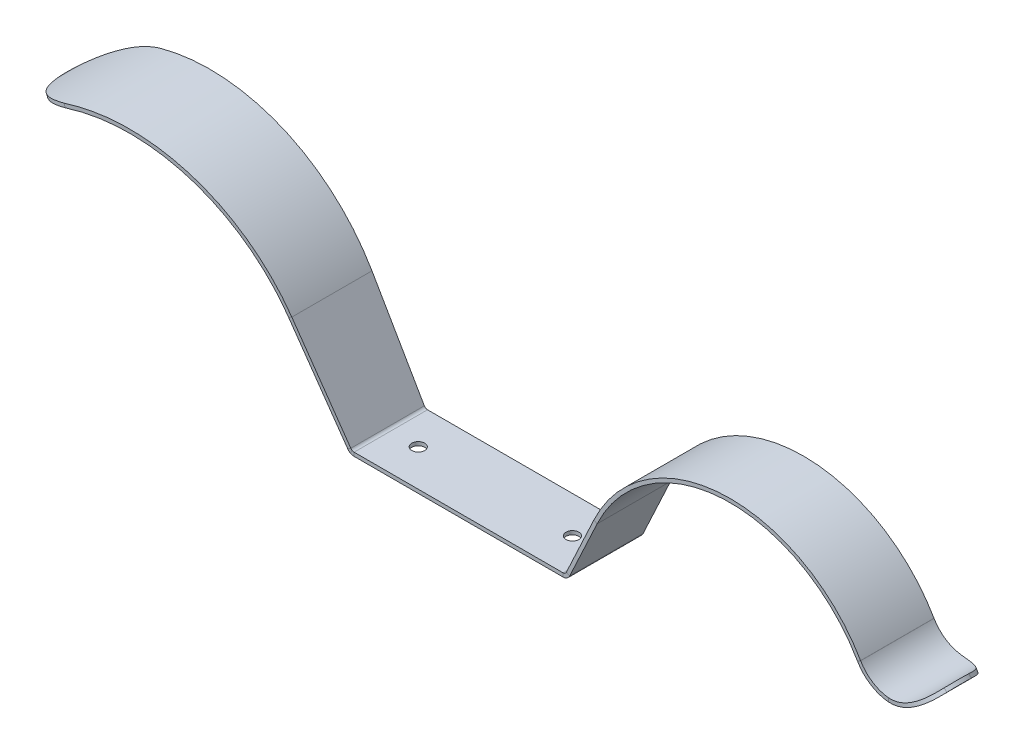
ISO-10303-21;
HEADER;
FILE_DESCRIPTION(('STEP AP214'),'2;1');
FILE_NAME('part.step','',(''),(''),'','','');
FILE_SCHEMA(('AUTOMOTIVE_DESIGN { 1 0 10303 214 1 1 1 1 }'));
ENDSEC;
DATA;
#1=APPLICATION_CONTEXT('core data for automotive mechanical design processes');
#2=APPLICATION_PROTOCOL_DEFINITION('international standard','automotive_design',2000,#1);
#3=PRODUCT_CONTEXT('',#1,'mechanical');
#4=PRODUCT('Part','Part','',(#3));
#5=PRODUCT_RELATED_PRODUCT_CATEGORY('part','',(#4));
#6=PRODUCT_DEFINITION_FORMATION('','',#4);
#7=PRODUCT_DEFINITION_CONTEXT('part definition',#1,'design');
#8=PRODUCT_DEFINITION('design','',#6,#7);
#9=PRODUCT_DEFINITION_SHAPE('','',#8);
#10=(LENGTH_UNIT() NAMED_UNIT(*) SI_UNIT(.MILLI.,.METRE.));
#11=(NAMED_UNIT(*) PLANE_ANGLE_UNIT() SI_UNIT($,.RADIAN.));
#12=(NAMED_UNIT(*) SI_UNIT($,.STERADIAN.) SOLID_ANGLE_UNIT());
#13=UNCERTAINTY_MEASURE_WITH_UNIT(LENGTH_MEASURE(1.E-05),#10,'distance_accuracy_value','');
#14=(GEOMETRIC_REPRESENTATION_CONTEXT(3) GLOBAL_UNCERTAINTY_ASSIGNED_CONTEXT((#13)) GLOBAL_UNIT_ASSIGNED_CONTEXT((#10,
#11,#12)) REPRESENTATION_CONTEXT('',''));
#15=CARTESIAN_POINT('',(0.,0.,0.));
#16=DIRECTION('',(0.,0.,1.));
#17=DIRECTION('',(1.,0.,0.));
#18=AXIS2_PLACEMENT_3D('',#15,#16,#17);
#19=CARTESIAN_POINT('',(88.4387510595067,-137.601801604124,0.));
#20=DIRECTION('',(0.,0.,1.));
#21=DIRECTION('',(0.422618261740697,0.906307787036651,0.));
#22=AXIS2_PLACEMENT_3D('',#19,#20,#21);
#23=PLANE('',#22);
#24=DIRECTION('',(-0.422618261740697,-0.906307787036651,0.));
#25=VECTOR('',#24,1.);
#26=CARTESIAN_POINT('',(88.4387510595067,-137.601801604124,0.));
#27=LINE('',#26,#25);
#28=CARTESIAN_POINT('',(160.82583423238,17.6327992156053,0.));
#29=VERTEX_POINT('',#28);
#30=CARTESIAN_POINT('',(153.339070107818,1.57738173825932,0.));
#31=VERTEX_POINT('',#30);
#32=EDGE_CURVE('E105',#29,#31,#27,.T.);
#33=ORIENTED_EDGE('',*,*,#32,.F.);
#34=DIRECTION('',(0.906307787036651,-0.422618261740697,0.));
#35=VECTOR('',#34,1.);
#36=CARTESIAN_POINT('',(160.82583423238,17.6327992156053,0.));
#37=LINE('',#36,#35);
#38=CARTESIAN_POINT('',(161.732142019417,17.2101809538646,0.));
#39=VERTEX_POINT('',#38);
#40=EDGE_CURVE('E14',#29,#39,#37,.T.);
#41=ORIENTED_EDGE('',*,*,#40,.T.);
#42=DIRECTION('',(-0.422618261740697,-0.906307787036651,0.));
#43=VECTOR('',#42,1.);
#44=CARTESIAN_POINT('',(89.3450588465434,-138.024419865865,0.));
#45=LINE('',#44,#43);
#46=CARTESIAN_POINT('',(154.245377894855,1.15476347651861,0.));
#47=VERTEX_POINT('',#46);
#48=EDGE_CURVE('E712',#39,#47,#45,.T.);
#49=ORIENTED_EDGE('',*,*,#48,.T.);
#50=DIRECTION('',(-0.906307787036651,0.422618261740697,0.));
#51=VECTOR('',#50,1.);
#52=CARTESIAN_POINT('',(153.339070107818,1.5773817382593,0.));
#53=LINE('',#52,#51);
#54=EDGE_CURVE('E719',#47,#31,#53,.T.);
#55=ORIENTED_EDGE('',*,*,#54,.T.);
#56=EDGE_LOOP('',(#33,#41,#49,#55));
#57=FACE_BOUND('',#56,.T.);
#58=ADVANCED_FACE('F102',(#57),#23,.F.);
#59=CARTESIAN_POINT('',(89.3450588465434,-138.024419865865,13.));
#60=DIRECTION('',(-0.906307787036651,0.422618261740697,0.));
#61=DIRECTION('',(0.,0.,1.));
#62=AXIS2_PLACEMENT_3D('',#59,#60,#61);
#63=PLANE('',#62);
#64=ORIENTED_EDGE('',*,*,#48,.F.);
#65=DIRECTION('',(0.,0.,1.));
#66=VECTOR('',#65,1.);
#67=CARTESIAN_POINT('',(161.732142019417,17.2101809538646,13.));
#68=LINE('',#67,#66);
#69=CARTESIAN_POINT('',(161.732142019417,17.2101809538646,20.0000000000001));
#70=VERTEX_POINT('',#69);
#71=EDGE_CURVE('E110',#39,#70,#68,.T.);
#72=ORIENTED_EDGE('',*,*,#71,.T.);
#73=DIRECTION('',(0.422618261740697,0.906307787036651,0.));
#74=VECTOR('',#73,1.);
#75=CARTESIAN_POINT('',(202.60675299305,104.866067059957,20.0000000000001));
#76=LINE('',#75,#74);
#77=CARTESIAN_POINT('',(154.245377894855,1.15476347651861,20.0000000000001));
#78=VERTEX_POINT('',#77);
#79=EDGE_CURVE('E1526',#78,#70,#76,.T.);
#80=ORIENTED_EDGE('',*,*,#79,.F.);
#81=DIRECTION('',(0.,0.,-1.));
#82=VECTOR('',#81,1.);
#83=CARTESIAN_POINT('',(154.245377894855,1.15476347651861,13.));
#84=LINE('',#83,#82);
#85=EDGE_CURVE('E715',#78,#47,#84,.T.);
#86=ORIENTED_EDGE('',*,*,#85,.T.);
#87=EDGE_LOOP('',(#64,#72,#80,#86));
#88=FACE_BOUND('',#87,.T.);
#89=ADVANCED_FACE('F713',(#88),#63,.F.);
#90=CARTESIAN_POINT('',(201.700445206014,105.288685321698,20.0000000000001));
#91=DIRECTION('',(0.,0.,-1.));
#92=DIRECTION('',(-0.422618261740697,-0.906307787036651,0.));
#93=AXIS2_PLACEMENT_3D('',#90,#91,#92);
#94=PLANE('',#93);
#95=ORIENTED_EDGE('',*,*,#79,.T.);
#96=DIRECTION('',(-0.906307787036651,0.422618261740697,0.));
#97=VECTOR('',#96,1.);
#98=CARTESIAN_POINT('',(160.82583423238,17.6327992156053,20.0000000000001));
#99=LINE('',#98,#97);
#100=CARTESIAN_POINT('',(160.82583423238,17.6327992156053,20.0000000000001));
#101=VERTEX_POINT('',#100);
#102=EDGE_CURVE('E709',#70,#101,#99,.T.);
#103=ORIENTED_EDGE('',*,*,#102,.T.);
#104=DIRECTION('',(0.422618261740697,0.906307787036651,0.));
#105=VECTOR('',#104,1.);
#106=CARTESIAN_POINT('',(153.099345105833,1.06328981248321,20.0000000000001));
#107=LINE('',#106,#105);
#108=CARTESIAN_POINT('',(153.339070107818,1.5773817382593,20.0000000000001));
#109=VERTEX_POINT('',#108);
#110=EDGE_CURVE('E728',#109,#101,#107,.T.);
#111=ORIENTED_EDGE('',*,*,#110,.F.);
#112=DIRECTION('',(0.906307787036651,-0.422618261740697,0.));
#113=VECTOR('',#112,1.);
#114=CARTESIAN_POINT('',(153.339070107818,1.5773817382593,20.0000000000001));
#115=LINE('',#114,#113);
#116=EDGE_CURVE('E1527',#109,#78,#115,.T.);
#117=ORIENTED_EDGE('',*,*,#116,.T.);
#118=EDGE_LOOP('',(#95,#103,#111,#117));
#119=FACE_BOUND('',#118,.T.);
#120=ADVANCED_FACE('F868',(#119),#94,.F.);
#121=CARTESIAN_POINT('',(47.4193806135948,83.3189589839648,13.));
#122=DIRECTION('',(0.86602540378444,0.499999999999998,0.));
#123=DIRECTION('',(0.,0.,1.));
#124=AXIS2_PLACEMENT_3D('',#121,#122,#123);
#125=PLANE('',#124);
#126=DIRECTION('',(-0.499999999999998,0.86602540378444,0.));
#127=VECTOR('',#126,1.);
#128=CARTESIAN_POINT('',(47.4193806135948,83.3189589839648,0.));
#129=LINE('',#128,#127);
#130=CARTESIAN_POINT('',(94.6575786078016,1.5,0.));
#131=VERTEX_POINT('',#130);
#132=CARTESIAN_POINT('',(80.3899439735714,26.2122680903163,0.));
#133=VERTEX_POINT('',#132);
#134=EDGE_CURVE('E787',#131,#133,#129,.T.);
#135=ORIENTED_EDGE('',*,*,#134,.T.);
#136=DIRECTION('',(0.,0.,1.));
#137=VECTOR('',#136,1.);
#138=CARTESIAN_POINT('',(80.3899439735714,26.2122680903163,13.0000000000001));
#139=LINE('',#138,#137);
#140=CARTESIAN_POINT('',(80.3899439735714,26.2122680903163,21.8352972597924));
#141=VERTEX_POINT('',#140);
#142=EDGE_CURVE('E733',#133,#141,#139,.T.);
#143=ORIENTED_EDGE('',*,*,#142,.T.);
#144=DIRECTION('',(0.499005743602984,-0.864303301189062,-0.0630323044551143));
#145=VECTOR('',#144,1.);
#146=CARTESIAN_POINT('',(94.9193806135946,1.04654562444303,20.));
#147=LINE('',#146,#145);
#148=CARTESIAN_POINT('',(94.6575786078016,1.50000000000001,20.0330697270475));
#149=VERTEX_POINT('',#148);
#150=EDGE_CURVE('E782',#141,#149,#147,.T.);
#151=ORIENTED_EDGE('',*,*,#150,.T.);
#152=DIRECTION('',(0.,0.,1.));
#153=VECTOR('',#152,1.);
#154=CARTESIAN_POINT('',(94.6575786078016,1.5,13.0000000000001));
#155=LINE('',#154,#153);
#156=EDGE_CURVE('E790',#131,#149,#155,.T.);
#157=ORIENTED_EDGE('',*,*,#156,.F.);
#158=EDGE_LOOP('',(#135,#143,#151,#157));
#159=FACE_BOUND('',#158,.T.);
#160=ADVANCED_FACE('F864',(#159),#125,.T.);
#161=CARTESIAN_POINT('',(88.4387510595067,-137.601801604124,13.));
#162=DIRECTION('',(-0.906307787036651,0.422618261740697,0.));
#163=DIRECTION('',(0.,0.,1.));
#164=AXIS2_PLACEMENT_3D('',#161,#162,#163);
#165=PLANE('',#164);
#166=DIRECTION('',(0.,0.,1.));
#167=VECTOR('',#166,1.);
#168=CARTESIAN_POINT('',(160.82583423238,17.6327992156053,13.));
#169=LINE('',#168,#167);
#170=EDGE_CURVE('E622',#29,#101,#169,.T.);
#171=ORIENTED_EDGE('',*,*,#170,.F.);
#172=ORIENTED_EDGE('',*,*,#32,.T.);
#173=DIRECTION('',(0.,0.,-1.));
#174=VECTOR('',#173,1.);
#175=CARTESIAN_POINT('',(153.339070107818,1.5773817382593,13.));
#176=LINE('',#175,#174);
#177=EDGE_CURVE('E570',#109,#31,#176,.T.);
#178=ORIENTED_EDGE('',*,*,#177,.F.);
#179=ORIENTED_EDGE('',*,*,#110,.T.);
#180=EDGE_LOOP('',(#171,#172,#178,#179));
#181=FACE_BOUND('',#180,.T.);
#182=ADVANCED_FACE('F726',(#181),#165,.T.);
#183=CARTESIAN_POINT('',(0.,1.,13.));
#184=DIRECTION('',(0.,1.,0.));
#185=DIRECTION('',(0.,0.,1.));
#186=AXIS2_PLACEMENT_3D('',#183,#184,#185);
#187=PLANE('',#186);
#188=CARTESIAN_POINT('',(103.,1.,10.));
#189=DIRECTION('',(0.,1.,0.));
#190=DIRECTION('',(0.,0.,1.));
#191=AXIS2_PLACEMENT_3D('',#188,#189,#190);
#192=CIRCLE('',#191,1.75);
#193=CARTESIAN_POINT('',(103.,1.,11.75));
#194=VERTEX_POINT('',#193);
#195=EDGE_CURVE('E813',#194,#194,#192,.T.);
#196=ORIENTED_EDGE('',*,*,#195,.F.);
#197=EDGE_LOOP('',(#196));
#198=FACE_BOUND('',#197,.T.);
#199=CARTESIAN_POINT('',(145.,1.,10.));
#200=DIRECTION('',(0.,1.,0.));
#201=DIRECTION('',(0.,0.,1.));
#202=AXIS2_PLACEMENT_3D('',#199,#200,#201);
#203=CIRCLE('',#202,1.75000000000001);
#204=CARTESIAN_POINT('',(145.,1.,11.7500000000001));
#205=VERTEX_POINT('',#204);
#206=EDGE_CURVE('E819',#205,#205,#203,.T.);
#207=ORIENTED_EDGE('',*,*,#206,.F.);
#208=EDGE_LOOP('',(#207));
#209=FACE_BOUND('',#208,.T.);
#210=DIRECTION('',(1.,0.,0.));
#211=VECTOR('',#210,1.);
#212=CARTESIAN_POINT('',(153.,1.,20.0000000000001));
#213=LINE('',#212,#211);
#214=CARTESIAN_POINT('',(95.5236040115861,1.,20.));
#215=VERTEX_POINT('',#214);
#216=CARTESIAN_POINT('',(152.432762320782,1.,20.0000000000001));
#217=VERTEX_POINT('',#216);
#218=EDGE_CURVE('E795',#215,#217,#213,.T.);
#219=ORIENTED_EDGE('',*,*,#218,.T.);
#220=DIRECTION('',(0.,0.,-1.));
#221=VECTOR('',#220,1.);
#222=CARTESIAN_POINT('',(152.432762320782,1.,13.));
#223=LINE('',#222,#221);
#224=CARTESIAN_POINT('',(152.432762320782,1.,0.));
#225=VERTEX_POINT('',#224);
#226=EDGE_CURVE('E840',#217,#225,#223,.T.);
#227=ORIENTED_EDGE('',*,*,#226,.T.);
#228=DIRECTION('',(-1.,0.,0.));
#229=VECTOR('',#228,1.);
#230=CARTESIAN_POINT('',(0.,1.,0.));
#231=LINE('',#230,#229);
#232=CARTESIAN_POINT('',(95.5236040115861,1.,0.));
#233=VERTEX_POINT('',#232);
#234=EDGE_CURVE('E811',#225,#233,#231,.T.);
#235=ORIENTED_EDGE('',*,*,#234,.T.);
#236=DIRECTION('',(0.,0.,1.));
#237=VECTOR('',#236,1.);
#238=CARTESIAN_POINT('',(95.5236040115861,1.,13.0000000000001));
#239=LINE('',#238,#237);
#240=EDGE_CURVE('E812',#233,#215,#239,.T.);
#241=ORIENTED_EDGE('',*,*,#240,.T.);
#242=EDGE_LOOP('',(#219,#227,#235,#241));
#243=FACE_BOUND('',#242,.T.);
#244=ADVANCED_FACE('F874',(#198,#209,#243),#187,.T.);
#245=CARTESIAN_POINT('',(47.4193806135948,83.3189589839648,0.));
#246=DIRECTION('',(0.,0.,1.));
#247=DIRECTION('',(0.499999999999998,-0.86602540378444,0.));
#248=AXIS2_PLACEMENT_3D('',#245,#246,#247);
#249=PLANE('',#248);
#250=DIRECTION('',(-0.86602540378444,-0.499999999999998,0.));
#251=VECTOR('',#250,1.);
#252=CARTESIAN_POINT('',(80.3899439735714,26.2122680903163,0.));
#253=LINE('',#252,#251);
#254=CARTESIAN_POINT('',(79.523918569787,25.7122680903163,0.));
#255=VERTEX_POINT('',#254);
#256=EDGE_CURVE('E582',#133,#255,#253,.T.);
#257=ORIENTED_EDGE('',*,*,#256,.F.);
#258=ORIENTED_EDGE('',*,*,#134,.F.);
#259=DIRECTION('',(-0.86602540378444,-0.499999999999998,0.));
#260=VECTOR('',#259,1.);
#261=CARTESIAN_POINT('',(94.6575786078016,1.5,0.));
#262=LINE('',#261,#260);
#263=CARTESIAN_POINT('',(93.7915532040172,1.,0.));
#264=VERTEX_POINT('',#263);
#265=EDGE_CURVE('E837',#131,#264,#262,.T.);
#266=ORIENTED_EDGE('',*,*,#265,.T.);
#267=DIRECTION('',(-0.499999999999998,0.86602540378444,0.));
#268=VECTOR('',#267,1.);
#269=CARTESIAN_POINT('',(46.5533552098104,82.8189589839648,0.));
#270=LINE('',#269,#268);
#271=EDGE_CURVE('E788',#264,#255,#270,.T.);
#272=ORIENTED_EDGE('',*,*,#271,.T.);
#273=EDGE_LOOP('',(#257,#258,#266,#272));
#274=FACE_BOUND('',#273,.T.);
#275=ADVANCED_FACE('F862',(#274),#249,.F.);
#276=CARTESIAN_POINT('',(94.9193806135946,1.04654562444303,20.));
#277=DIRECTION('',(-0.0315161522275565,0.0545875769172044,-0.998011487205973));
#278=DIRECTION('',(-0.499005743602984,0.864303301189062,0.0630323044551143));
#279=AXIS2_PLACEMENT_3D('',#276,#277,#278);
#280=PLANE('',#279);
#281=CARTESIAN_POINT('',(79.523918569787,25.7122680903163,21.8352972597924));
#282=CARTESIAN_POINT('',(80.3899439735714,26.2122680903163,21.8352972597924));
#283=B_SPLINE_CURVE_WITH_KNOTS('',1,(#281,#282),.UNSPECIFIED.,.F.,.F.,(2,2),(0.,1.),.UNSPECIFIED.);
#284=CARTESIAN_POINT('',(79.523918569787,25.7122680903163,21.8352972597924));
#285=VERTEX_POINT('',#284);
#286=EDGE_CURVE('E730',#285,#141,#283,.T.);
#287=ORIENTED_EDGE('',*,*,#286,.F.);
#288=DIRECTION('',(0.499005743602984,-0.864303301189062,-0.0630323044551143));
#289=VECTOR('',#288,1.);
#290=CARTESIAN_POINT('',(94.0533552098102,0.546545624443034,20.));
#291=LINE('',#290,#289);
#292=CARTESIAN_POINT('',(93.7915532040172,1.,20.0330697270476));
#293=VERTEX_POINT('',#292);
#294=EDGE_CURVE('E126',#285,#293,#291,.T.);
#295=ORIENTED_EDGE('',*,*,#294,.T.);
#296=CARTESIAN_POINT('',(94.6575786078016,1.50000000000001,20.0330697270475));
#297=CARTESIAN_POINT('',(93.7915532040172,1.00000000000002,20.0330697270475));
#298=B_SPLINE_CURVE_WITH_KNOTS('',1,(#296,#297),.UNSPECIFIED.,.F.,.F.,(2,2),(0.,1.),.UNSPECIFIED.);
#299=EDGE_CURVE('E784',#293,#149,#298,.F.);
#300=ORIENTED_EDGE('',*,*,#299,.T.);
#301=ORIENTED_EDGE('',*,*,#150,.F.);
#302=EDGE_LOOP('',(#287,#295,#300,#301));
#303=FACE_BOUND('',#302,.T.);
#304=ADVANCED_FACE('F780',(#303),#280,.F.);
#305=CARTESIAN_POINT('',(46.5533552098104,82.8189589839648,13.));
#306=DIRECTION('',(0.86602540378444,0.499999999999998,0.));
#307=DIRECTION('',(0.,0.,1.));
#308=AXIS2_PLACEMENT_3D('',#305,#306,#307);
#309=PLANE('',#308);
#310=DIRECTION('',(0.,0.,1.));
#311=VECTOR('',#310,1.);
#312=CARTESIAN_POINT('',(79.523918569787,25.7122680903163,13.0000000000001));
#313=LINE('',#312,#311);
#314=EDGE_CURVE('E731',#255,#285,#313,.T.);
#315=ORIENTED_EDGE('',*,*,#314,.F.);
#316=ORIENTED_EDGE('',*,*,#271,.F.);
#317=DIRECTION('',(0.,0.,1.));
#318=VECTOR('',#317,1.);
#319=CARTESIAN_POINT('',(93.7915532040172,1.,13.0000000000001));
#320=LINE('',#319,#318);
#321=EDGE_CURVE('E841',#264,#293,#320,.T.);
#322=ORIENTED_EDGE('',*,*,#321,.T.);
#323=ORIENTED_EDGE('',*,*,#294,.F.);
#324=EDGE_LOOP('',(#315,#316,#322,#323));
#325=FACE_BOUND('',#324,.T.);
#326=ADVANCED_FACE('F861',(#325),#309,.F.);
#327=CARTESIAN_POINT('',(145.,1.,10.));
#328=DIRECTION('',(0.,-1.,0.));
#329=DIRECTION('',(0.,0.,-1.));
#330=AXIS2_PLACEMENT_3D('',#327,#328,#329);
#331=CYLINDRICAL_SURFACE('',#330,1.75000000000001);
#332=ORIENTED_EDGE('',*,*,#206,.T.);
#333=EDGE_LOOP('',(#332));
#334=FACE_BOUND('',#333,.T.);
#335=CARTESIAN_POINT('',(145.,0.,10.));
#336=DIRECTION('',(0.,1.,0.));
#337=DIRECTION('',(0.,0.,1.));
#338=AXIS2_PLACEMENT_3D('',#335,#336,#337);
#339=CIRCLE('',#338,1.75000000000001);
#340=CARTESIAN_POINT('',(145.,0.,11.7500000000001));
#341=VERTEX_POINT('',#340);
#342=EDGE_CURVE('E799',#341,#341,#339,.T.);
#343=ORIENTED_EDGE('',*,*,#342,.F.);
#344=EDGE_LOOP('',(#343));
#345=FACE_BOUND('',#344,.T.);
#346=ADVANCED_FACE('F871',(#334,#345),#331,.F.);
#347=CARTESIAN_POINT('',(103.,1.,10.));
#348=DIRECTION('',(0.,-1.,0.));
#349=DIRECTION('',(0.,0.,-1.));
#350=AXIS2_PLACEMENT_3D('',#347,#348,#349);
#351=CYLINDRICAL_SURFACE('',#350,1.75);
#352=ORIENTED_EDGE('',*,*,#195,.T.);
#353=EDGE_LOOP('',(#352));
#354=FACE_BOUND('',#353,.T.);
#355=CARTESIAN_POINT('',(103.,0.,10.));
#356=DIRECTION('',(0.,1.,0.));
#357=DIRECTION('',(0.,0.,1.));
#358=AXIS2_PLACEMENT_3D('',#355,#356,#357);
#359=CIRCLE('',#358,1.75);
#360=CARTESIAN_POINT('',(103.,0.,11.75));
#361=VERTEX_POINT('',#360);
#362=EDGE_CURVE('E806',#361,#361,#359,.T.);
#363=ORIENTED_EDGE('',*,*,#362,.F.);
#364=EDGE_LOOP('',(#363));
#365=FACE_BOUND('',#364,.T.);
#366=ADVANCED_FACE('F1047',(#354,#365),#351,.F.);
#367=CARTESIAN_POINT('',(268.,1.,20.0000000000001));
#368=DIRECTION('',(0.,0.,-1.));
#369=DIRECTION('',(-1.,0.,0.));
#370=AXIS2_PLACEMENT_3D('',#367,#368,#369);
#371=PLANE('',#370);
#372=DIRECTION('',(0.,-1.,0.));
#373=VECTOR('',#372,1.);
#374=CARTESIAN_POINT('',(152.432762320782,1.,20.0000000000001));
#375=LINE('',#374,#373);
#376=CARTESIAN_POINT('',(152.432762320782,0.,20.0000000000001));
#377=VERTEX_POINT('',#376);
#378=EDGE_CURVE('E1657',#217,#377,#375,.T.);
#379=ORIENTED_EDGE('',*,*,#378,.F.);
#380=ORIENTED_EDGE('',*,*,#218,.F.);
#381=DIRECTION('',(0.,1.,0.));
#382=VECTOR('',#381,1.);
#383=CARTESIAN_POINT('',(95.5236040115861,1.,20.0000000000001));
#384=LINE('',#383,#382);
#385=CARTESIAN_POINT('',(95.5236040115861,0.,20.0000000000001));
#386=VERTEX_POINT('',#385);
#387=EDGE_CURVE('E824',#386,#215,#384,.T.);
#388=ORIENTED_EDGE('',*,*,#387,.F.);
#389=DIRECTION('',(1.,0.,0.));
#390=VECTOR('',#389,1.);
#391=CARTESIAN_POINT('',(268.,0.,20.0000000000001));
#392=LINE('',#391,#390);
#393=EDGE_CURVE('E810',#386,#377,#392,.T.);
#394=ORIENTED_EDGE('',*,*,#393,.T.);
#395=EDGE_LOOP('',(#379,#380,#388,#394));
#396=FACE_BOUND('',#395,.T.);
#397=ADVANCED_FACE('F1035',(#396),#371,.F.);
#398=CARTESIAN_POINT('',(0.,0.,13.));
#399=DIRECTION('',(0.,1.,0.));
#400=DIRECTION('',(0.,0.,1.));
#401=AXIS2_PLACEMENT_3D('',#398,#399,#400);
#402=PLANE('',#401);
#403=DIRECTION('',(0.,0.,-1.));
#404=VECTOR('',#403,1.);
#405=CARTESIAN_POINT('',(152.432762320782,0.,13.));
#406=LINE('',#405,#404);
#407=CARTESIAN_POINT('',(152.432762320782,0.,0.));
#408=VERTEX_POINT('',#407);
#409=EDGE_CURVE('E772',#377,#408,#406,.T.);
#410=ORIENTED_EDGE('',*,*,#409,.F.);
#411=ORIENTED_EDGE('',*,*,#393,.F.);
#412=DIRECTION('',(0.,0.,1.));
#413=VECTOR('',#412,1.);
#414=CARTESIAN_POINT('',(95.5236040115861,0.,13.0000000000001));
#415=LINE('',#414,#413);
#416=CARTESIAN_POINT('',(95.5236040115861,0.,0.));
#417=VERTEX_POINT('',#416);
#418=EDGE_CURVE('E830',#417,#386,#415,.T.);
#419=ORIENTED_EDGE('',*,*,#418,.F.);
#420=DIRECTION('',(-1.,0.,0.));
#421=VECTOR('',#420,1.);
#422=CARTESIAN_POINT('',(0.,0.,0.));
#423=LINE('',#422,#421);
#424=EDGE_CURVE('E797',#408,#417,#423,.T.);
#425=ORIENTED_EDGE('',*,*,#424,.F.);
#426=EDGE_LOOP('',(#410,#411,#419,#425));
#427=FACE_BOUND('',#426,.T.);
#428=ORIENTED_EDGE('',*,*,#362,.T.);
#429=EDGE_LOOP('',(#428));
#430=FACE_BOUND('',#429,.T.);
#431=ORIENTED_EDGE('',*,*,#342,.T.);
#432=EDGE_LOOP('',(#431));
#433=FACE_BOUND('',#432,.T.);
#434=ADVANCED_FACE('F1024',(#427,#430,#433),#402,.F.);
#435=CARTESIAN_POINT('',(0.,1.,0.));
#436=DIRECTION('',(0.,0.,1.));
#437=DIRECTION('',(1.,0.,0.));
#438=AXIS2_PLACEMENT_3D('',#435,#436,#437);
#439=PLANE('',#438);
#440=DIRECTION('',(0.,1.,0.));
#441=VECTOR('',#440,1.);
#442=CARTESIAN_POINT('',(152.432762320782,1.,0.));
#443=LINE('',#442,#441);
#444=EDGE_CURVE('E769',#408,#225,#443,.T.);
#445=ORIENTED_EDGE('',*,*,#444,.F.);
#446=ORIENTED_EDGE('',*,*,#424,.T.);
#447=DIRECTION('',(0.,-1.,0.));
#448=VECTOR('',#447,1.);
#449=CARTESIAN_POINT('',(95.5236040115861,1.,0.));
#450=LINE('',#449,#448);
#451=EDGE_CURVE('E833',#233,#417,#450,.T.);
#452=ORIENTED_EDGE('',*,*,#451,.F.);
#453=ORIENTED_EDGE('',*,*,#234,.F.);
#454=EDGE_LOOP('',(#445,#446,#452,#453));
#455=FACE_BOUND('',#454,.T.);
#456=ADVANCED_FACE('F1018',(#455),#439,.F.);
#457=CARTESIAN_POINT('',(95.5236040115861,2.,0.));
#458=DIRECTION('',(0.,0.,1.));
#459=DIRECTION('',(1.,0.,0.));
#460=AXIS2_PLACEMENT_3D('',#457,#458,#459);
#461=PLANE('',#460);
#462=ORIENTED_EDGE('',*,*,#451,.T.);
#463=CARTESIAN_POINT('',(95.5236040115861,2.,0.));
#464=DIRECTION('',(0.,0.,1.));
#465=DIRECTION('',(1.,0.,0.));
#466=AXIS2_PLACEMENT_3D('',#463,#464,#465);
#467=CIRCLE('',#466,2.);
#468=EDGE_CURVE('E1542',#417,#264,#467,.F.);
#469=ORIENTED_EDGE('',*,*,#468,.T.);
#470=ORIENTED_EDGE('',*,*,#265,.F.);
#471=CARTESIAN_POINT('',(95.5236040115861,2.,0.));
#472=DIRECTION('',(0.,0.,-1.));
#473=DIRECTION('',(-1.,0.,0.));
#474=AXIS2_PLACEMENT_3D('',#471,#472,#473);
#475=CIRCLE('',#474,1.00000000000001);
#476=EDGE_CURVE('E1548',#233,#131,#475,.T.);
#477=ORIENTED_EDGE('',*,*,#476,.F.);
#478=EDGE_LOOP('',(#462,#469,#470,#477));
#479=FACE_BOUND('',#478,.T.);
#480=ADVANCED_FACE('F1023',(#479),#461,.F.);
#481=CARTESIAN_POINT('',(93.7915532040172,1.00000000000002,20.0330697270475));
#482=CARTESIAN_POINT('',(93.9663684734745,0.69721107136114,20.0220286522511));
#483=CARTESIAN_POINT('',(94.2208150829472,0.442764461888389,20.0110410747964));
#484=CARTESIAN_POINT('',(94.5236040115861,0.267949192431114,20.));
#485=CARTESIAN_POINT('',(94.6575786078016,1.50000000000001,20.0330697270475));
#486=CARTESIAN_POINT('',(94.7449859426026,1.34860605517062,20.0220286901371));
#487=CARTESIAN_POINT('',(94.8722100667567,1.22138193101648,20.0110410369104));
#488=CARTESIAN_POINT('',(95.0236040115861,1.13397459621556,20.));
#489=B_SPLINE_SURFACE_WITH_KNOTS('',1,3,((#481,#482,#483,#484),(#485,#486,#487,#488)),
.UNSPECIFIED.,.F.,.F.,.F.,(2,2),(4,4),(0.,1.),(0.,1.),.UNSPECIFIED.);
#490=CARTESIAN_POINT('',(93.7915532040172,1.00000000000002,20.0330697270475));
#491=CARTESIAN_POINT('',(93.9663684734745,0.69721107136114,20.0220286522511));
#492=CARTESIAN_POINT('',(94.2208150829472,0.442764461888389,20.0110410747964));
#493=CARTESIAN_POINT('',(94.5236040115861,0.267949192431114,20.));
#494=B_SPLINE_CURVE_WITH_KNOTS('',3,(#490,#491,#492,#493),.UNSPECIFIED.,.F.,.F.,(4,4),(0.,1.),.UNSPECIFIED.);
#495=CARTESIAN_POINT('',(94.5236040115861,0.267949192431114,20.));
#496=VERTEX_POINT('',#495);
#497=EDGE_CURVE('E1581',#293,#496,#494,.T.);
#498=CARTESIAN_POINT('',(94.5236040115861,0.267949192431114,20.));
#499=CARTESIAN_POINT('',(95.0236040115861,1.13397459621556,20.));
#500=B_SPLINE_CURVE_WITH_KNOTS('',1,(#498,#499),.UNSPECIFIED.,.F.,.F.,(2,2),(0.,1.),.UNSPECIFIED.);
#501=CARTESIAN_POINT('',(95.0236040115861,1.13397459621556,20.));
#502=VERTEX_POINT('',#501);
#503=EDGE_CURVE('E836',#496,#502,#500,.T.);
#504=CARTESIAN_POINT('',(95.0236040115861,1.13397459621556,20.));
#505=CARTESIAN_POINT('',(94.8722100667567,1.22138193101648,20.0110410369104));
#506=CARTESIAN_POINT('',(94.7449859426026,1.34860605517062,20.0220286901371));
#507=CARTESIAN_POINT('',(94.6575786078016,1.50000000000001,20.0330697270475));
#508=B_SPLINE_CURVE_WITH_KNOTS('',3,(#504,#505,#506,#507),.UNSPECIFIED.,.F.,.F.,(4,4),(0.,1.),.UNSPECIFIED.);
#509=EDGE_CURVE('E1551',#149,#502,#508,.F.);
#510=ORIENTED_EDGE('',*,*,#299,.F.);
#511=ORIENTED_EDGE('',*,*,#497,.T.);
#512=ORIENTED_EDGE('',*,*,#503,.T.);
#513=ORIENTED_EDGE('',*,*,#509,.F.);
#514=EDGE_LOOP('',(#510,#511,#512,#513));
#515=FACE_BOUND('',#514,.T.);
#516=ADVANCED_FACE('F1080',(#515),#489,.F.);
#517=CARTESIAN_POINT('',(95.5236040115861,2.,20.));
#518=DIRECTION('',(0.,0.,-1.));
#519=DIRECTION('',(-1.,0.,0.));
#520=AXIS2_PLACEMENT_3D('',#517,#518,#519);
#521=PLANE('',#520);
#522=CARTESIAN_POINT('',(95.5236040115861,2.,20.));
#523=DIRECTION('',(0.,0.,1.));
#524=DIRECTION('',(1.,0.,0.));
#525=AXIS2_PLACEMENT_3D('',#522,#523,#524);
#526=CIRCLE('',#525,2.);
#527=EDGE_CURVE('E1552',#496,#386,#526,.T.);
#528=ORIENTED_EDGE('',*,*,#527,.T.);
#529=ORIENTED_EDGE('',*,*,#387,.T.);
#530=CARTESIAN_POINT('',(95.5236040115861,2.,20.));
#531=DIRECTION('',(0.,0.,1.));
#532=DIRECTION('',(1.,0.,0.));
#533=AXIS2_PLACEMENT_3D('',#530,#531,#532);
#534=CIRCLE('',#533,1.);
#535=EDGE_CURVE('E1642',#502,#215,#534,.T.);
#536=ORIENTED_EDGE('',*,*,#535,.F.);
#537=ORIENTED_EDGE('',*,*,#503,.F.);
#538=EDGE_LOOP('',(#528,#529,#536,#537));
#539=FACE_BOUND('',#538,.T.);
#540=ADVANCED_FACE('F1069',(#539),#521,.F.);
#541=CARTESIAN_POINT('',(95.5236040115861,2.,-10.0853311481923));
#542=DIRECTION('',(0.,0.,1.));
#543=DIRECTION('',(1.,0.,0.));
#544=AXIS2_PLACEMENT_3D('',#541,#542,#543);
#545=CYLINDRICAL_SURFACE('',#544,1.);
#546=ORIENTED_EDGE('',*,*,#509,.T.);
#547=ORIENTED_EDGE('',*,*,#535,.T.);
#548=ORIENTED_EDGE('',*,*,#240,.F.);
#549=ORIENTED_EDGE('',*,*,#476,.T.);
#550=ORIENTED_EDGE('',*,*,#156,.T.);
#551=EDGE_LOOP('',(#546,#547,#548,#549,#550));
#552=FACE_BOUND('',#551,.T.);
#553=ADVANCED_FACE('F1066',(#552),#545,.F.);
#554=CARTESIAN_POINT('',(95.5236040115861,2.,-10.0853311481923));
#555=DIRECTION('',(0.,0.,1.));
#556=DIRECTION('',(1.,0.,0.));
#557=AXIS2_PLACEMENT_3D('',#554,#555,#556);
#558=CYLINDRICAL_SURFACE('',#557,2.);
#559=ORIENTED_EDGE('',*,*,#497,.F.);
#560=ORIENTED_EDGE('',*,*,#321,.F.);
#561=ORIENTED_EDGE('',*,*,#468,.F.);
#562=ORIENTED_EDGE('',*,*,#418,.T.);
#563=ORIENTED_EDGE('',*,*,#527,.F.);
#564=EDGE_LOOP('',(#559,#560,#561,#562,#563));
#565=FACE_BOUND('',#564,.T.);
#566=ADVANCED_FACE('F1009',(#565),#558,.T.);
#567=CARTESIAN_POINT('',(152.432762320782,2.,20.0000000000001));
#568=DIRECTION('',(0.,0.,-1.));
#569=DIRECTION('',(-1.,0.,0.));
#570=AXIS2_PLACEMENT_3D('',#567,#568,#569);
#571=PLANE('',#570);
#572=ORIENTED_EDGE('',*,*,#378,.T.);
#573=CARTESIAN_POINT('',(152.432762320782,2.,20.0000000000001));
#574=DIRECTION('',(0.,0.,-1.));
#575=DIRECTION('',(-1.,0.,0.));
#576=AXIS2_PLACEMENT_3D('',#573,#574,#575);
#577=CIRCLE('',#576,2.);
#578=EDGE_CURVE('E1543',#377,#78,#577,.F.);
#579=ORIENTED_EDGE('',*,*,#578,.T.);
#580=ORIENTED_EDGE('',*,*,#116,.F.);
#581=CARTESIAN_POINT('',(152.432762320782,2.,20.0000000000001));
#582=DIRECTION('',(0.,0.,1.));
#583=DIRECTION('',(1.,0.,0.));
#584=AXIS2_PLACEMENT_3D('',#581,#582,#583);
#585=CIRCLE('',#584,0.999999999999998);
#586=EDGE_CURVE('E1537',#217,#109,#585,.T.);
#587=ORIENTED_EDGE('',*,*,#586,.F.);
#588=EDGE_LOOP('',(#572,#579,#580,#587));
#589=FACE_BOUND('',#588,.T.);
#590=ADVANCED_FACE('F990',(#589),#571,.F.);
#591=CARTESIAN_POINT('',(152.432762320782,2.,0.));
#592=DIRECTION('',(0.,0.,1.));
#593=DIRECTION('',(1.,0.,0.));
#594=AXIS2_PLACEMENT_3D('',#591,#592,#593);
#595=PLANE('',#594);
#596=CARTESIAN_POINT('',(152.432762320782,2.,0.));
#597=DIRECTION('',(0.,0.,-1.));
#598=DIRECTION('',(-1.,0.,0.));
#599=AXIS2_PLACEMENT_3D('',#596,#597,#598);
#600=CIRCLE('',#599,2.);
#601=EDGE_CURVE('E1540',#47,#408,#600,.T.);
#602=ORIENTED_EDGE('',*,*,#601,.T.);
#603=ORIENTED_EDGE('',*,*,#444,.T.);
#604=CARTESIAN_POINT('',(152.432762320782,2.,0.));
#605=DIRECTION('',(0.,0.,-1.));
#606=DIRECTION('',(-1.,0.,0.));
#607=AXIS2_PLACEMENT_3D('',#604,#605,#606);
#608=CIRCLE('',#607,0.999999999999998);
#609=EDGE_CURVE('E1539',#31,#225,#608,.T.);
#610=ORIENTED_EDGE('',*,*,#609,.F.);
#611=ORIENTED_EDGE('',*,*,#54,.F.);
#612=EDGE_LOOP('',(#602,#603,#610,#611));
#613=FACE_BOUND('',#612,.T.);
#614=ADVANCED_FACE('F979',(#613),#595,.F.);
#615=CARTESIAN_POINT('',(152.432762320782,2.,30.0570943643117));
#616=DIRECTION('',(0.,0.,-1.));
#617=DIRECTION('',(-1.,0.,0.));
#618=AXIS2_PLACEMENT_3D('',#615,#616,#617);
#619=CYLINDRICAL_SURFACE('',#618,1.);
#620=ORIENTED_EDGE('',*,*,#177,.T.);
#621=ORIENTED_EDGE('',*,*,#609,.T.);
#622=ORIENTED_EDGE('',*,*,#226,.F.);
#623=ORIENTED_EDGE('',*,*,#586,.T.);
#624=EDGE_LOOP('',(#620,#621,#622,#623));
#625=FACE_BOUND('',#624,.T.);
#626=ADVANCED_FACE('F458',(#625),#619,.F.);
#627=CARTESIAN_POINT('',(152.432762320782,2.,30.0570943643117));
#628=DIRECTION('',(0.,0.,-1.));
#629=DIRECTION('',(-1.,0.,0.));
#630=AXIS2_PLACEMENT_3D('',#627,#628,#629);
#631=CYLINDRICAL_SURFACE('',#630,2.);
#632=ORIENTED_EDGE('',*,*,#85,.F.);
#633=ORIENTED_EDGE('',*,*,#578,.F.);
#634=ORIENTED_EDGE('',*,*,#409,.T.);
#635=ORIENTED_EDGE('',*,*,#601,.F.);
#636=EDGE_LOOP('',(#632,#633,#634,#635));
#637=FACE_BOUND('',#636,.T.);
#638=ADVANCED_FACE('F946',(#637),#631,.T.);
#639=CARTESIAN_POINT('',(36.222648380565,0.712268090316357,0.));
#640=DIRECTION('',(0.,0.,-1.));
#641=DIRECTION('',(-1.,0.,0.));
#642=AXIS2_PLACEMENT_3D('',#639,#640,#641);
#643=PLANE('',#642);
#644=ORIENTED_EDGE('',*,*,#256,.T.);
#645=CARTESIAN_POINT('',(36.222648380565,0.712268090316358,0.));
#646=DIRECTION('',(0.,0.,1.));
#647=DIRECTION('',(1.,0.,0.));
#648=AXIS2_PLACEMENT_3D('',#645,#646,#647);
#649=CIRCLE('',#648,50.);
#650=CARTESIAN_POINT('',(22.8078013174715,48.8790811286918,0.));
#651=VERTEX_POINT('',#650);
#652=EDGE_CURVE('E574',#255,#651,#649,.T.);
#653=ORIENTED_EDGE('',*,*,#652,.T.);
#654=CARTESIAN_POINT('',(22.5395043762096,49.8424173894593,0.));
#655=CARTESIAN_POINT('',(22.8078013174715,48.8790811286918,0.));
#656=B_SPLINE_CURVE_WITH_KNOTS('',1,(#654,#655),.UNSPECIFIED.,.F.,.F.,(2,2),(0.,1.),.UNSPECIFIED.);
#657=CARTESIAN_POINT('',(22.5395043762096,49.8424173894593,0.));
#658=VERTEX_POINT('',#657);
#659=EDGE_CURVE('E549',#651,#658,#656,.F.);
#660=ORIENTED_EDGE('',*,*,#659,.T.);
#661=CARTESIAN_POINT('',(36.222648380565,0.712268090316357,0.));
#662=DIRECTION('',(0.,0.,1.));
#663=DIRECTION('',(1.,0.,0.));
#664=AXIS2_PLACEMENT_3D('',#661,#662,#663);
#665=CIRCLE('',#664,51.);
#666=EDGE_CURVE('E763',#133,#658,#665,.T.);
#667=ORIENTED_EDGE('',*,*,#666,.F.);
#668=EDGE_LOOP('',(#644,#653,#660,#667));
#669=FACE_BOUND('',#668,.T.);
#670=ADVANCED_FACE('F456',(#669),#643,.T.);
#671=CARTESIAN_POINT('',(22.5395043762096,49.8424173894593,0.));
#672=CARTESIAN_POINT('',(21.7008721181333,49.6088515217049,0.0433123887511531));
#673=CARTESIAN_POINT('',(20.9446686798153,49.3752958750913,0.122622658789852));
#674=CARTESIAN_POINT('',(19.9302789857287,49.0411976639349,0.29559176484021));
#675=CARTESIAN_POINT('',(19.6121362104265,48.9325021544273,0.362248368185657));
#676=CARTESIAN_POINT('',(19.1644279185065,48.7751658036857,0.475733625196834));
#677=CARTESIAN_POINT('',(19.0201094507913,48.7236692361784,0.515812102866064));
#678=CARTESIAN_POINT('',(18.8109495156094,48.648040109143,0.579304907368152));
#679=CARTESIAN_POINT('',(18.742449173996,48.6230995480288,0.601031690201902));
#680=CARTESIAN_POINT('',(18.6415208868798,48.5861152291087,0.634465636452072));
#681=CARTESIAN_POINT('',(18.6081818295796,48.573858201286,0.64575091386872));
#682=CARTESIAN_POINT('',(18.5586279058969,48.5555820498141,0.662889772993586));
#683=CARTESIAN_POINT('',(18.5421857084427,48.5495082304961,0.668637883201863));
#684=CARTESIAN_POINT('',(18.5176359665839,48.5404251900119,0.677312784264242));
#685=CARTESIAN_POINT('',(18.5094716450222,48.5374021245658,0.680213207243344));
#686=CARTESIAN_POINT('',(18.4972535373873,48.5328744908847,0.684577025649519));
#687=CARTESIAN_POINT('',(18.4931855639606,48.5313664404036,0.68603382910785));
#688=CARTESIAN_POINT('',(18.4870906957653,48.5291061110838,0.688222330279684));
#689=CARTESIAN_POINT('',(18.4850602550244,48.5283529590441,0.688952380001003));
#690=CARTESIAN_POINT('',(18.4810017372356,48.5268472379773,0.690413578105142));
#691=CARTESIAN_POINT('',(18.4795193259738,48.5262971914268,0.690947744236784));
#692=CARTESIAN_POINT('',(17.8183711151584,48.2809137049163,0.929618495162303));
#693=CARTESIAN_POINT('',(17.1949711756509,48.0340901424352,1.21652793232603));
#694=CARTESIAN_POINT('',(16.3112742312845,47.6658517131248,1.72064313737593));
#695=CARTESIAN_POINT('',(16.0252732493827,47.5434316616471,1.90097338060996));
#696=CARTESIAN_POINT('',(15.4701498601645,47.3000953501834,2.28621755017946));
#697=CARTESIAN_POINT('',(15.2014895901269,47.1793913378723,2.49074649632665));
#698=CARTESIAN_POINT('',(13.8951081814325,46.5795059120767,3.57870023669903));
#699=CARTESIAN_POINT('',(13.0289924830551,46.1400225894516,4.60442917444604));
#700=CARTESIAN_POINT('',(11.6303711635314,45.3983560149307,6.96661894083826));
#701=CARTESIAN_POINT('',(11.0977007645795,45.0961002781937,8.30309290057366));
#702=CARTESIAN_POINT('',(10.7226483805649,44.8795636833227,9.79490654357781));
#703=CARTESIAN_POINT('',(22.8078013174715,48.8790811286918,0.));
#704=CARTESIAN_POINT('',(21.9856128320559,48.6500949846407,0.0433123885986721));
#705=CARTESIAN_POINT('',(21.2442369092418,48.4211188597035,0.122622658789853));
#706=CARTESIAN_POINT('',(20.2497372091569,48.0935715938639,0.29559176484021));
#707=CARTESIAN_POINT('',(19.9378325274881,47.9870073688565,0.362248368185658));
#708=CARTESIAN_POINT('',(19.4989028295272,47.8327560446,0.475733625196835));
#709=CARTESIAN_POINT('',(19.3574141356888,47.7822692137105,0.515812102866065));
#710=CARTESIAN_POINT('',(19.1523553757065,47.7081230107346,0.579304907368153));
#711=CARTESIAN_POINT('',(19.0851981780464,47.6836714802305,0.601031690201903));
#712=CARTESIAN_POINT('',(18.986248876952,47.6474123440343,0.634465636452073));
#713=CARTESIAN_POINT('',(18.9535635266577,47.6353956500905,0.64575091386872));
#714=CARTESIAN_POINT('',(18.9049812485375,47.6174778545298,0.662889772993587));
#715=CARTESIAN_POINT('',(18.8888614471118,47.6115231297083,0.668637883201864));
#716=CARTESIAN_POINT('',(18.8647930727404,47.6026181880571,0.677312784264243));
#717=CARTESIAN_POINT('',(18.8567888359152,47.5996543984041,0.680213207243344));
#718=CARTESIAN_POINT('',(18.8448102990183,47.5952155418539,0.68457702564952));
#719=CARTESIAN_POINT('',(18.8408220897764,47.5937370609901,0.686033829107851));
#720=CARTESIAN_POINT('',(18.8348467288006,47.5915210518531,0.688222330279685));
#721=CARTESIAN_POINT('',(18.8328561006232,47.5907826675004,0.688952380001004));
#722=CARTESIAN_POINT('',(18.8288771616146,47.5893064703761,0.690413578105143));
#723=CARTESIAN_POINT('',(18.8274238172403,47.5887672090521,0.690947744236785));
#724=CARTESIAN_POINT('',(18.179239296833,47.3481951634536,0.929618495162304));
#725=CARTESIAN_POINT('',(17.5680628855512,47.1062112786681,1.21652793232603));
#726=CARTESIAN_POINT('',(16.7016933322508,46.7451932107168,1.72064313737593));
#727=CARTESIAN_POINT('',(16.4213002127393,46.6251735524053,1.90097338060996));
#728=CARTESIAN_POINT('',(15.8770615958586,46.3866085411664,2.28621755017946));
#729=CARTESIAN_POINT('',(15.6136691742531,46.2682712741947,2.49074649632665));
#730=CARTESIAN_POINT('',(14.3329030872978,45.6801483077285,3.57870023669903));
#731=CARTESIAN_POINT('',(13.4837700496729,45.2492823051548,4.60442917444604));
#732=CARTESIAN_POINT('',(12.1125726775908,44.5221582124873,6.96661894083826));
#733=CARTESIAN_POINT('',(11.5903469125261,44.2258291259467,8.30309242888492));
#734=CARTESIAN_POINT('',(11.2226483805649,44.0135382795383,9.79490654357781));
#735=B_SPLINE_SURFACE_WITH_KNOTS('',1,3,((#671,#672,#673,#674,#675,#676,#677,#678,#679,#680,
#681,#682,#683,#684,#685,#686,#687,#688,#689,#690,#691,#692,#693,#694,#695,#696,#697,#698,#699,
#700,#701,#702),(#703,#704,#705,#706,#707,#708,#709,#710,#711,#712,#713,#714,#715,#716,#717,
#718,#719,#720,#721,#722,#723,#724,#725,#726,#727,#728,#729,#730,#731,#732,#733,#734)),
.UNSPECIFIED.,.F.,.F.,.F.,(2,2),(4,2,2,2,2,2,2,2,2,2,2,2,2,2,2,4),(0.,1.),(0.,0.125,0.1875,
0.21875,0.234375,0.2421875,0.24609375,0.248046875,0.2490234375,0.24951171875,0.25,0.375,0.4375,
0.5,0.75,1.),.UNSPECIFIED.);
#736=CARTESIAN_POINT('',(22.8078013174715,48.8790811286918,0.));
#737=CARTESIAN_POINT('',(21.9856128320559,48.6500949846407,0.0433123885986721));
#738=CARTESIAN_POINT('',(21.2442369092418,48.4211188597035,0.122622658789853));
#739=CARTESIAN_POINT('',(20.2497372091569,48.0935715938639,0.29559176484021));
#740=CARTESIAN_POINT('',(19.9378325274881,47.9870073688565,0.362248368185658));
#741=CARTESIAN_POINT('',(19.4989028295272,47.8327560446,0.475733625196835));
#742=CARTESIAN_POINT('',(19.3574141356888,47.7822692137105,0.515812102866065));
#743=CARTESIAN_POINT('',(19.1523553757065,47.7081230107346,0.579304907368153));
#744=CARTESIAN_POINT('',(19.0851981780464,47.6836714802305,0.601031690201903));
#745=CARTESIAN_POINT('',(18.986248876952,47.6474123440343,0.634465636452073));
#746=CARTESIAN_POINT('',(18.9535635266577,47.6353956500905,0.64575091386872));
#747=CARTESIAN_POINT('',(18.9049812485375,47.6174778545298,0.662889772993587));
#748=CARTESIAN_POINT('',(18.8888614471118,47.6115231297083,0.668637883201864));
#749=CARTESIAN_POINT('',(18.8647930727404,47.6026181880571,0.677312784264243));
#750=CARTESIAN_POINT('',(18.8567888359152,47.5996543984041,0.680213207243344));
#751=CARTESIAN_POINT('',(18.8448102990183,47.5952155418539,0.68457702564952));
#752=CARTESIAN_POINT('',(18.8408220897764,47.5937370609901,0.686033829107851));
#753=CARTESIAN_POINT('',(18.8348467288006,47.5915210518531,0.688222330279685));
#754=CARTESIAN_POINT('',(18.8328561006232,47.5907826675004,0.688952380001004));
#755=CARTESIAN_POINT('',(18.8288771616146,47.5893064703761,0.690413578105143));
#756=CARTESIAN_POINT('',(18.8274238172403,47.5887672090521,0.690947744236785));
#757=CARTESIAN_POINT('',(18.179239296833,47.3481951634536,0.929618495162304));
#758=CARTESIAN_POINT('',(17.5680628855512,47.1062112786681,1.21652793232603));
#759=CARTESIAN_POINT('',(16.7016933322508,46.7451932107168,1.72064313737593));
#760=CARTESIAN_POINT('',(16.4213002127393,46.6251735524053,1.90097338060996));
#761=CARTESIAN_POINT('',(15.8770615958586,46.3866085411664,2.28621755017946));
#762=CARTESIAN_POINT('',(15.6136691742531,46.2682712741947,2.49074649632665));
#763=CARTESIAN_POINT('',(14.3329030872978,45.6801483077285,3.57870023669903));
#764=CARTESIAN_POINT('',(13.4837700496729,45.2492823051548,4.60442917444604));
#765=CARTESIAN_POINT('',(12.1125726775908,44.5221582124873,6.96661894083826));
#766=CARTESIAN_POINT('',(11.5903469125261,44.2258291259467,8.30309242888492));
#767=CARTESIAN_POINT('',(11.2226483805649,44.0135382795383,9.79490654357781));
#768=B_SPLINE_CURVE_WITH_KNOTS('',3,(#736,#737,#738,#739,#740,#741,#742,#743,#744,#745,#746,
#747,#748,#749,#750,#751,#752,#753,#754,#755,#756,#757,#758,#759,#760,#761,#762,#763,#764,#765,
#766,#767),.UNSPECIFIED.,.F.,.F.,(4,2,2,2,2,2,2,2,2,2,2,2,2,2,2,4),(0.,0.125,0.1875,0.21875,
0.234375,0.2421875,0.24609375,0.248046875,0.2490234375,0.24951171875,0.25,0.375,0.4375,0.5,0.75,
1.),.UNSPECIFIED.);
#769=CARTESIAN_POINT('',(11.2226483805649,44.0135382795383,9.7949065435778));
#770=VERTEX_POINT('',#769);
#771=EDGE_CURVE('E567',#651,#770,#768,.T.);
#772=CARTESIAN_POINT('',(11.2226483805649,44.0135382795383,9.79490654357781));
#773=CARTESIAN_POINT('',(10.7226483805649,44.8795636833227,9.79490654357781));
#774=B_SPLINE_CURVE_WITH_KNOTS('',1,(#772,#773),.UNSPECIFIED.,.F.,.F.,(2,2),(0.,1.),.UNSPECIFIED.);
#775=CARTESIAN_POINT('',(10.7226483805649,44.8795636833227,9.79490654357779));
#776=VERTEX_POINT('',#775);
#777=EDGE_CURVE('E535',#776,#770,#774,.F.);
#778=CARTESIAN_POINT('',(10.7226483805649,44.8795636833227,9.79490654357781));
#779=CARTESIAN_POINT('',(11.0977007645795,45.0961002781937,8.30309290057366));
#780=CARTESIAN_POINT('',(11.6303711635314,45.3983560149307,6.96661894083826));
#781=CARTESIAN_POINT('',(13.0289924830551,46.1400225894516,4.60442917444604));
#782=CARTESIAN_POINT('',(13.8951081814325,46.5795059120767,3.57870023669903));
#783=CARTESIAN_POINT('',(15.2014895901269,47.1793913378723,2.49074649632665));
#784=CARTESIAN_POINT('',(15.4701498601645,47.3000953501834,2.28621755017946));
#785=CARTESIAN_POINT('',(16.0252732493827,47.5434316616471,1.90097338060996));
#786=CARTESIAN_POINT('',(16.3112742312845,47.6658517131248,1.72064313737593));
#787=CARTESIAN_POINT('',(17.1949711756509,48.0340901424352,1.21652793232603));
#788=CARTESIAN_POINT('',(17.8183711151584,48.2809137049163,0.929618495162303));
#789=CARTESIAN_POINT('',(18.4795193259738,48.5262971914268,0.690947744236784));
#790=CARTESIAN_POINT('',(18.4810017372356,48.5268472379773,0.690413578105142));
#791=CARTESIAN_POINT('',(18.4850602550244,48.5283529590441,0.688952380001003));
#792=CARTESIAN_POINT('',(18.4870906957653,48.5291061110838,0.688222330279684));
#793=CARTESIAN_POINT('',(18.4931855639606,48.5313664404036,0.68603382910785));
#794=CARTESIAN_POINT('',(18.4972535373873,48.5328744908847,0.684577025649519));
#795=CARTESIAN_POINT('',(18.5094716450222,48.5374021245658,0.680213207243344));
#796=CARTESIAN_POINT('',(18.5176359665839,48.5404251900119,0.677312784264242));
#797=CARTESIAN_POINT('',(18.5421857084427,48.5495082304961,0.668637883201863));
#798=CARTESIAN_POINT('',(18.5586279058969,48.5555820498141,0.662889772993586));
#799=CARTESIAN_POINT('',(18.6081818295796,48.573858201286,0.64575091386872));
#800=CARTESIAN_POINT('',(18.6415208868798,48.5861152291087,0.634465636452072));
#801=CARTESIAN_POINT('',(18.742449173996,48.6230995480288,0.601031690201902));
#802=CARTESIAN_POINT('',(18.8109495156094,48.648040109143,0.579304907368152));
#803=CARTESIAN_POINT('',(19.0201094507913,48.7236692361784,0.515812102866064));
#804=CARTESIAN_POINT('',(19.1644279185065,48.7751658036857,0.475733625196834));
#805=CARTESIAN_POINT('',(19.6121362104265,48.9325021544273,0.362248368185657));
#806=CARTESIAN_POINT('',(19.9302789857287,49.0411976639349,0.29559176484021));
#807=CARTESIAN_POINT('',(20.9446686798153,49.3752958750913,0.122622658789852));
#808=CARTESIAN_POINT('',(21.7008721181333,49.6088515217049,0.0433123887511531));
#809=CARTESIAN_POINT('',(22.5395043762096,49.8424173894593,0.));
#810=B_SPLINE_CURVE_WITH_KNOTS('',3,(#778,#779,#780,#781,#782,#783,#784,#785,#786,#787,#788,
#789,#790,#791,#792,#793,#794,#795,#796,#797,#798,#799,#800,#801,#802,#803,#804,#805,#806,#807,
#808,#809),.UNSPECIFIED.,.F.,.F.,(4,2,2,2,2,2,2,2,2,2,2,2,2,2,2,4),(0.,0.25,0.5,0.5625,0.625,
0.75,0.75048828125,0.7509765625,0.751953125,0.75390625,0.7578125,0.765625,0.78125,0.8125,0.875,
1.),.UNSPECIFIED.);
#811=EDGE_CURVE('E568',#658,#776,#810,.F.);
#812=ORIENTED_EDGE('',*,*,#659,.F.);
#813=ORIENTED_EDGE('',*,*,#771,.T.);
#814=ORIENTED_EDGE('',*,*,#777,.F.);
#815=ORIENTED_EDGE('',*,*,#811,.F.);
#816=EDGE_LOOP('',(#812,#813,#814,#815));
#817=FACE_BOUND('',#816,.T.);
#818=ADVANCED_FACE('F500',(#817),#735,.T.);
#819=CARTESIAN_POINT('',(10.7226483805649,44.8795636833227,16.2050934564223));
#820=CARTESIAN_POINT('',(10.9485826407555,45.0100068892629,17.0320407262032));
#821=CARTESIAN_POINT('',(11.1906635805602,45.1474712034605,17.7742493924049));
#822=CARTESIAN_POINT('',(11.5785912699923,45.3630500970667,18.7604533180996));
#823=CARTESIAN_POINT('',(11.7120353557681,45.4364718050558,19.0680031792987));
#824=CARTESIAN_POINT('',(11.9184806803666,45.5487885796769,19.4975508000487));
#825=CARTESIAN_POINT('',(11.9883423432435,45.5865914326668,19.6354371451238));
#826=CARTESIAN_POINT('',(12.0947144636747,45.6438207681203,19.8343223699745));
#827=CARTESIAN_POINT('',(12.1304351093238,45.6629847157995,19.899293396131));
#828=CARTESIAN_POINT('',(12.1844122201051,45.6918592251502,19.9947638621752));
#829=CARTESIAN_POINT('',(12.2024706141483,45.7015054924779,20.0262563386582));
#830=CARTESIAN_POINT('',(12.2296573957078,45.7160067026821,20.072998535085));
#831=CARTESIAN_POINT('',(12.2387361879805,45.7208457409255,20.0884965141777));
#832=CARTESIAN_POINT('',(12.2523791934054,45.7281122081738,20.1116193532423));
#833=CARTESIAN_POINT('',(12.2569309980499,45.7305356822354,20.1193062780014));
#834=CARTESIAN_POINT('',(12.2637649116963,45.7341728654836,20.1308056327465));
#835=CARTESIAN_POINT('',(12.2660439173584,45.7353855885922,20.1346335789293));
#836=CARTESIAN_POINT('',(12.2694639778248,45.7372051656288,20.140367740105));
#837=CARTESIAN_POINT('',(12.2706042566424,45.7378117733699,20.1422778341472));
#838=CARTESIAN_POINT('',(12.2728853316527,45.7390251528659,20.1460954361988));
#839=CARTESIAN_POINT('',(12.2737395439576,45.7394795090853,20.1475241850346));
#840=CARTESIAN_POINT('',(12.6406427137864,45.9346117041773,20.7604625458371));
#841=CARTESIAN_POINT('',(13.0446067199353,46.1438011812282,21.3275947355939));
#842=CARTESIAN_POINT('',(13.710323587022,46.4753174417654,22.1131612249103));
#843=CARTESIAN_POINT('',(13.9421929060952,46.5887688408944,22.3641614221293));
#844=CARTESIAN_POINT('',(14.3052091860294,46.7627172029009,22.7243787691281));
#845=CARTESIAN_POINT('',(14.4287500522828,46.821327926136,22.8417373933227));
#846=CARTESIAN_POINT('',(14.6178981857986,46.9100994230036,23.0137045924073));
#847=CARTESIAN_POINT('',(14.6815870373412,46.9398324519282,23.0703485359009));
#848=CARTESIAN_POINT('',(14.7780837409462,46.9846346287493,23.1542967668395));
#849=CARTESIAN_POINT('',(14.8104098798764,46.9996024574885,23.1821098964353));
#850=CARTESIAN_POINT('',(14.8753840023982,47.0296037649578,23.2373969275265));
#851=CARTESIAN_POINT('',(14.9085678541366,47.0448833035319,23.265316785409));
#852=CARTESIAN_POINT('',(15.9735896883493,47.5339198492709,24.1516417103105));
#853=CARTESIAN_POINT('',(17.1194179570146,48.0186037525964,24.8070270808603));
#854=CARTESIAN_POINT('',(19.6490841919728,48.9630688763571,25.7096353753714));
#855=CARTESIAN_POINT('',(21.0328952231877,49.4228145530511,25.9568543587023));
#856=CARTESIAN_POINT('',(22.5395043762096,49.8424173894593,26.));
#857=CARTESIAN_POINT('',(11.2226483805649,44.0135382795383,16.2050934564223));
#858=CARTESIAN_POINT('',(11.4441525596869,44.141423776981,17.0320407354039));
#859=CARTESIAN_POINT('',(11.6814868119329,44.2761927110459,17.7742493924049));
#860=CARTESIAN_POINT('',(12.061808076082,44.4875445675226,18.7604533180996));
#861=CARTESIAN_POINT('',(12.1926356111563,44.5595266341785,19.0680031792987));
#862=CARTESIAN_POINT('',(12.3950329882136,44.6696411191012,19.4975508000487));
#863=CARTESIAN_POINT('',(12.4635248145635,44.7067027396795,19.6354371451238));
#864=CARTESIAN_POINT('',(12.5678112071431,44.7628099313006,19.8343223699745));
#865=CARTESIAN_POINT('',(12.6028314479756,44.7815981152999,19.899293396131));
#866=CARTESIAN_POINT('',(12.6557501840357,44.8099064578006,19.9947638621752));
#867=CARTESIAN_POINT('',(12.6734544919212,44.8193635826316,20.0262563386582));
#868=CARTESIAN_POINT('',(12.7001081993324,44.8335804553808,20.072998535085));
#869=CARTESIAN_POINT('',(12.7090089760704,44.8383246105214,20.0884965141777));
#870=CARTESIAN_POINT('',(12.722384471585,44.8454485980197,20.1116193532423));
#871=CARTESIAN_POINT('',(12.7268470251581,44.8478245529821,20.1193062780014));
#872=CARTESIAN_POINT('',(12.7335469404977,44.8513904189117,20.1308056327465));
#873=CARTESIAN_POINT('',(12.7357812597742,44.8525793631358,20.1346335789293));
#874=CARTESIAN_POINT('',(12.7391342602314,44.8543632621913,20.140367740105));
#875=CARTESIAN_POINT('',(12.7402521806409,44.854957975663,20.1422778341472));
#876=CARTESIAN_POINT('',(12.7424885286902,44.8561475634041,20.1460954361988));
#877=CARTESIAN_POINT('',(12.7433259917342,44.856593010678,20.1475241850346));
#878=CARTESIAN_POINT('',(13.1030349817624,45.0478990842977,20.7604625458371));
#879=CARTESIAN_POINT('',(13.4990781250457,45.2529868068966,21.3275947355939));
#880=CARTESIAN_POINT('',(14.1517417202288,45.5780027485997,22.1131612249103));
#881=CARTESIAN_POINT('',(14.3790645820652,45.6892296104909,22.3641614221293));
#882=CARTESIAN_POINT('',(14.7349628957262,45.8597672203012,22.7243787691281));
#883=CARTESIAN_POINT('',(14.856081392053,45.917228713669,22.8417373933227));
#884=CARTESIAN_POINT('',(15.0415207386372,46.0042595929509,23.0137045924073));
#885=CARTESIAN_POINT('',(15.1039607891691,46.0334096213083,23.0703485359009));
#886=CARTESIAN_POINT('',(15.1985654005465,46.0773333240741,23.1542967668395));
#887=CARTESIAN_POINT('',(15.2302576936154,46.0920076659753,23.1821098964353));
#888=CARTESIAN_POINT('',(15.2939578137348,46.1214207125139,23.2373969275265));
#889=CARTESIAN_POINT('',(15.3264910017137,46.1364006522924,23.265316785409));
#890=CARTESIAN_POINT('',(16.3706300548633,46.6158482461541,24.1516417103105));
#891=CARTESIAN_POINT('',(17.4939911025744,47.0910285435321,24.8070270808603));
#892=CARTESIAN_POINT('',(19.974056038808,48.0169747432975,25.7096353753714));
#893=CARTESIAN_POINT('',(21.3307335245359,48.4677058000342,25.9568543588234));
#894=CARTESIAN_POINT('',(22.8078013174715,48.8790811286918,26.));
#895=B_SPLINE_SURFACE_WITH_KNOTS('',1,3,((#819,#820,#821,#822,#823,#824,#825,#826,#827,#828,
#829,#830,#831,#832,#833,#834,#835,#836,#837,#838,#839,#840,#841,#842,#843,#844,#845,#846,#847,
#848,#849,#850,#851,#852,#853,#854,#855,#856),(#857,#858,#859,#860,#861,#862,#863,#864,#865,
#866,#867,#868,#869,#870,#871,#872,#873,#874,#875,#876,#877,#878,#879,#880,#881,#882,#883,#884,
#885,#886,#887,#888,#889,#890,#891,#892,#893,#894)),.UNSPECIFIED.,.F.,.F.,.F.,(2,2),(4,2,2,2,2,
2,2,2,2,2,2,2,2,2,2,2,2,2,4),(0.,1.),(0.,0.125,0.1875,0.21875,0.234375,0.2421875,0.24609375,
0.248046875,0.2490234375,0.24951171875,0.25,0.375,0.4375,0.46875,0.484375,0.4921875,0.5,0.75,
1.),.UNSPECIFIED.);
#896=CARTESIAN_POINT('',(10.7226483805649,44.8795636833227,16.2050934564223));
#897=CARTESIAN_POINT('',(11.2226483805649,44.0135382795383,16.2050934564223));
#898=B_SPLINE_CURVE_WITH_KNOTS('',1,(#896,#897),.UNSPECIFIED.,.F.,.F.,(2,2),(0.,1.),.UNSPECIFIED.);
#899=CARTESIAN_POINT('',(11.2226483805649,44.0135382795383,16.2050934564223));
#900=VERTEX_POINT('',#899);
#901=CARTESIAN_POINT('',(10.7226483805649,44.8795636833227,16.2050934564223));
#902=VERTEX_POINT('',#901);
#903=EDGE_CURVE('E584',#900,#902,#898,.F.);
#904=CARTESIAN_POINT('',(11.2226483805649,44.0135382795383,16.2050934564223));
#905=CARTESIAN_POINT('',(11.4441525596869,44.141423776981,17.0320407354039));
#906=CARTESIAN_POINT('',(11.6814868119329,44.2761927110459,17.7742493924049));
#907=CARTESIAN_POINT('',(12.061808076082,44.4875445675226,18.7604533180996));
#908=CARTESIAN_POINT('',(12.1926356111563,44.5595266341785,19.0680031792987));
#909=CARTESIAN_POINT('',(12.3950329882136,44.6696411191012,19.4975508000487));
#910=CARTESIAN_POINT('',(12.4635248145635,44.7067027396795,19.6354371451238));
#911=CARTESIAN_POINT('',(12.5678112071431,44.7628099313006,19.8343223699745));
#912=CARTESIAN_POINT('',(12.6028314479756,44.7815981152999,19.899293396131));
#913=CARTESIAN_POINT('',(12.6557501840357,44.8099064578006,19.9947638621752));
#914=CARTESIAN_POINT('',(12.6734544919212,44.8193635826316,20.0262563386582));
#915=CARTESIAN_POINT('',(12.7001081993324,44.8335804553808,20.072998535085));
#916=CARTESIAN_POINT('',(12.7090089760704,44.8383246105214,20.0884965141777));
#917=CARTESIAN_POINT('',(12.722384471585,44.8454485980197,20.1116193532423));
#918=CARTESIAN_POINT('',(12.7268470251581,44.8478245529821,20.1193062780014));
#919=CARTESIAN_POINT('',(12.7335469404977,44.8513904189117,20.1308056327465));
#920=CARTESIAN_POINT('',(12.7357812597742,44.8525793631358,20.1346335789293));
#921=CARTESIAN_POINT('',(12.7391342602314,44.8543632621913,20.140367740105));
#922=CARTESIAN_POINT('',(12.7402521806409,44.854957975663,20.1422778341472));
#923=CARTESIAN_POINT('',(12.7424885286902,44.8561475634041,20.1460954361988));
#924=CARTESIAN_POINT('',(12.7433259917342,44.856593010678,20.1475241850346));
#925=CARTESIAN_POINT('',(13.1030349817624,45.0478990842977,20.7604625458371));
#926=CARTESIAN_POINT('',(13.4990781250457,45.2529868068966,21.3275947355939));
#927=CARTESIAN_POINT('',(14.1517417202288,45.5780027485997,22.1131612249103));
#928=CARTESIAN_POINT('',(14.3790645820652,45.6892296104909,22.3641614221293));
#929=CARTESIAN_POINT('',(14.7349628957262,45.8597672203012,22.7243787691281));
#930=CARTESIAN_POINT('',(14.856081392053,45.917228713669,22.8417373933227));
#931=CARTESIAN_POINT('',(15.0415207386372,46.0042595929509,23.0137045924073));
#932=CARTESIAN_POINT('',(15.1039607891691,46.0334096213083,23.0703485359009));
#933=CARTESIAN_POINT('',(15.1985654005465,46.0773333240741,23.1542967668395));
#934=CARTESIAN_POINT('',(15.2302576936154,46.0920076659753,23.1821098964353));
#935=CARTESIAN_POINT('',(15.2939578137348,46.1214207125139,23.2373969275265));
#936=CARTESIAN_POINT('',(15.3264910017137,46.1364006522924,23.265316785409));
#937=CARTESIAN_POINT('',(16.3706300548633,46.6158482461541,24.1516417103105));
#938=CARTESIAN_POINT('',(17.4939911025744,47.0910285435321,24.8070270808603));
#939=CARTESIAN_POINT('',(19.974056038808,48.0169747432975,25.7096353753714));
#940=CARTESIAN_POINT('',(21.3307335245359,48.4677058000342,25.9568543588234));
#941=CARTESIAN_POINT('',(22.8078013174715,48.8790811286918,26.));
#942=B_SPLINE_CURVE_WITH_KNOTS('',3,(#904,#905,#906,#907,#908,#909,#910,#911,#912,#913,#914,
#915,#916,#917,#918,#919,#920,#921,#922,#923,#924,#925,#926,#927,#928,#929,#930,#931,#932,#933,
#934,#935,#936,#937,#938,#939,#940,#941),.UNSPECIFIED.,.F.,.F.,(4,2,2,2,2,2,2,2,2,2,2,2,2,2,2,2,
2,2,4),(0.,0.125,0.1875,0.21875,0.234375,0.2421875,0.24609375,0.248046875,0.2490234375,
0.24951171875,0.25,0.375,0.4375,0.46875,0.484375,0.4921875,0.5,0.75,1.),.UNSPECIFIED.);
#943=CARTESIAN_POINT('',(22.8078013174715,48.8790811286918,26.));
#944=VERTEX_POINT('',#943);
#945=EDGE_CURVE('E577',#900,#944,#942,.T.);
#946=CARTESIAN_POINT('',(22.8078013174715,48.8790811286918,26.));
#947=CARTESIAN_POINT('',(22.5395043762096,49.8424173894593,26.));
#948=B_SPLINE_CURVE_WITH_KNOTS('',1,(#946,#947),.UNSPECIFIED.,.F.,.F.,(2,2),(0.,1.),.UNSPECIFIED.);
#949=CARTESIAN_POINT('',(22.5395043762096,49.8424173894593,26.));
#950=VERTEX_POINT('',#949);
#951=EDGE_CURVE('E487',#944,#950,#948,.T.);
#952=CARTESIAN_POINT('',(22.5395043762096,49.8424173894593,26.));
#953=CARTESIAN_POINT('',(21.0328952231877,49.4228145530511,25.9568543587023));
#954=CARTESIAN_POINT('',(19.6490841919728,48.9630688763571,25.7096353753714));
#955=CARTESIAN_POINT('',(17.1194179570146,48.0186037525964,24.8070270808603));
#956=CARTESIAN_POINT('',(15.9735896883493,47.5339198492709,24.1516417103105));
#957=CARTESIAN_POINT('',(14.9085678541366,47.0448833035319,23.265316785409));
#958=CARTESIAN_POINT('',(14.8753840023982,47.0296037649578,23.2373969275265));
#959=CARTESIAN_POINT('',(14.8104098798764,46.9996024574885,23.1821098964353));
#960=CARTESIAN_POINT('',(14.7780837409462,46.9846346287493,23.1542967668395));
#961=CARTESIAN_POINT('',(14.6815870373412,46.9398324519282,23.0703485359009));
#962=CARTESIAN_POINT('',(14.6178981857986,46.9100994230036,23.0137045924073));
#963=CARTESIAN_POINT('',(14.4287500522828,46.821327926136,22.8417373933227));
#964=CARTESIAN_POINT('',(14.3052091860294,46.7627172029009,22.7243787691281));
#965=CARTESIAN_POINT('',(13.9421929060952,46.5887688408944,22.3641614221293));
#966=CARTESIAN_POINT('',(13.710323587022,46.4753174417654,22.1131612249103));
#967=CARTESIAN_POINT('',(13.0446067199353,46.1438011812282,21.3275947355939));
#968=CARTESIAN_POINT('',(12.6406427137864,45.9346117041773,20.7604625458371));
#969=CARTESIAN_POINT('',(12.2737395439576,45.7394795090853,20.1475241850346));
#970=CARTESIAN_POINT('',(12.2728853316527,45.7390251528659,20.1460954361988));
#971=CARTESIAN_POINT('',(12.2706042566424,45.7378117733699,20.1422778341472));
#972=CARTESIAN_POINT('',(12.2694639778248,45.7372051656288,20.140367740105));
#973=CARTESIAN_POINT('',(12.2660439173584,45.7353855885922,20.1346335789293));
#974=CARTESIAN_POINT('',(12.2637649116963,45.7341728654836,20.1308056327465));
#975=CARTESIAN_POINT('',(12.2569309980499,45.7305356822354,20.1193062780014));
#976=CARTESIAN_POINT('',(12.2523791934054,45.7281122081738,20.1116193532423));
#977=CARTESIAN_POINT('',(12.2387361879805,45.7208457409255,20.0884965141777));
#978=CARTESIAN_POINT('',(12.2296573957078,45.7160067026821,20.072998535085));
#979=CARTESIAN_POINT('',(12.2024706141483,45.7015054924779,20.0262563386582));
#980=CARTESIAN_POINT('',(12.1844122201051,45.6918592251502,19.9947638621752));
#981=CARTESIAN_POINT('',(12.1304351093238,45.6629847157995,19.899293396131));
#982=CARTESIAN_POINT('',(12.0947144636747,45.6438207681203,19.8343223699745));
#983=CARTESIAN_POINT('',(11.9883423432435,45.5865914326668,19.6354371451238));
#984=CARTESIAN_POINT('',(11.9184806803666,45.5487885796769,19.4975508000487));
#985=CARTESIAN_POINT('',(11.7120353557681,45.4364718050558,19.0680031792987));
#986=CARTESIAN_POINT('',(11.5785912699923,45.3630500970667,18.7604533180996));
#987=CARTESIAN_POINT('',(11.1906635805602,45.1474712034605,17.7742493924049));
#988=CARTESIAN_POINT('',(10.9485826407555,45.0100068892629,17.0320407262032));
#989=CARTESIAN_POINT('',(10.7226483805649,44.8795636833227,16.2050934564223));
#990=B_SPLINE_CURVE_WITH_KNOTS('',3,(#952,#953,#954,#955,#956,#957,#958,#959,#960,#961,#962,
#963,#964,#965,#966,#967,#968,#969,#970,#971,#972,#973,#974,#975,#976,#977,#978,#979,#980,#981,
#982,#983,#984,#985,#986,#987,#988,#989),.UNSPECIFIED.,.F.,.F.,(4,2,2,2,2,2,2,2,2,2,2,2,2,2,2,2,
2,2,4),(0.,0.25,0.5,0.5078125,0.515625,0.53125,0.5625,0.625,0.75,0.75048828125,0.7509765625,
0.751953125,0.75390625,0.7578125,0.765625,0.78125,0.8125,0.875,1.),.UNSPECIFIED.);
#991=EDGE_CURVE('E750',#902,#950,#990,.F.);
#992=ORIENTED_EDGE('',*,*,#903,.F.);
#993=ORIENTED_EDGE('',*,*,#945,.T.);
#994=ORIENTED_EDGE('',*,*,#951,.T.);
#995=ORIENTED_EDGE('',*,*,#991,.F.);
#996=EDGE_LOOP('',(#992,#993,#994,#995));
#997=FACE_BOUND('',#996,.T.);
#998=ADVANCED_FACE('F390',(#997),#895,.T.);
#999=CARTESIAN_POINT('',(22.5395043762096,49.8424173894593,26.));
#1000=CARTESIAN_POINT('',(25.2392668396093,50.5943230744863,25.8264697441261));
#1001=CARTESIAN_POINT('',(28.0010822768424,51.1231780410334,25.6529414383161));
#1002=CARTESIAN_POINT('',(33.5741581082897,51.7204977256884,25.3058828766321));
#1003=CARTESIAN_POINT('',(36.3853348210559,51.7889508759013,25.1323535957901));
#1004=CARTESIAN_POINT('',(41.9808782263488,51.463591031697,24.7852950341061));
#1005=CARTESIAN_POINT('',(44.7651761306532,51.0697820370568,24.6117657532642));
#1006=CARTESIAN_POINT('',(50.231464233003,49.8305647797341,24.2647071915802));
#1007=CARTESIAN_POINT('',(52.9133872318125,48.9851717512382,24.0911779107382));
#1008=CARTESIAN_POINT('',(58.1022019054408,46.8656983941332,23.7441193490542));
#1009=CARTESIAN_POINT('',(60.6090297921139,45.5916441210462,23.5705900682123));
#1010=CARTESIAN_POINT('',(65.379676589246,42.6493840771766,23.2235315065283));
#1011=CARTESIAN_POINT('',(67.643436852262,40.9812144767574,23.0500022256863));
#1012=CARTESIAN_POINT('',(71.8665599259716,37.2959469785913,22.7029436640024));
#1013=CARTESIAN_POINT('',(73.8258708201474,35.2788943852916,22.5294143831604));
#1014=CARTESIAN_POINT('',(77.3869604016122,30.9505452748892,22.1823558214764));
#1015=CARTESIAN_POINT('',(78.9886874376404,28.6393156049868,22.0088275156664));
#1016=CARTESIAN_POINT('',(80.3899439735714,26.2122680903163,21.8352972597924));
#1017=CARTESIAN_POINT('',(22.8078013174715,48.8790811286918,26.));
#1018=CARTESIAN_POINT('',(25.4546272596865,49.6162435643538,25.8264697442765));
#1019=CARTESIAN_POINT('',(28.1622894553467,50.1347288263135,25.6529414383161));
#1020=CARTESIAN_POINT('',(33.626089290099,50.720336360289,25.3058828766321));
#1021=CARTESIAN_POINT('',(36.3821448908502,50.7874472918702,25.1323535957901));
#1022=CARTESIAN_POINT('',(41.8679717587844,50.4684670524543,24.7852950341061));
#1023=CARTESIAN_POINT('',(44.5976755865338,50.082379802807,24.6117657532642));
#1024=CARTESIAN_POINT('',(49.9567815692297,48.8674609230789,24.2647071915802));
#1025=CARTESIAN_POINT('',(52.5861178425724,48.038644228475,24.0911779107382));
#1026=CARTESIAN_POINT('',(57.6731910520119,45.9607291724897,23.7441193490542));
#1027=CARTESIAN_POINT('',(60.130865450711,44.7116563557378,23.5705900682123));
#1028=CARTESIAN_POINT('',(64.8079701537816,41.8270876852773,23.2235315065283));
#1029=CARTESIAN_POINT('',(67.0273429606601,40.1916272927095,23.0500022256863));
#1030=CARTESIAN_POINT('',(71.1676596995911,36.5786199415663,22.7029436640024));
#1031=CARTESIAN_POINT('',(73.0885527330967,34.6011173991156,22.5294143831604));
#1032=CARTESIAN_POINT('',(76.5798170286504,30.3576378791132,22.1823558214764));
#1033=CARTESIAN_POINT('',(78.1501376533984,28.0917264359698,22.008827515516));
#1034=CARTESIAN_POINT('',(79.523918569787,25.7122680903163,21.8352972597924));
#1035=B_SPLINE_SURFACE_WITH_KNOTS('',1,3,((#999,#1000,#1001,#1002,#1003,#1004,#1005,#1006,#1007,
#1008,#1009,#1010,#1011,#1012,#1013,#1014,#1015,#1016),(#1017,#1018,#1019,#1020,#1021,#1022,
#1023,#1024,#1025,#1026,#1027,#1028,#1029,#1030,#1031,#1032,#1033,#1034)),.UNSPECIFIED.,.F.,.F.,
.F.,(2,2),(4,2,2,2,2,2,2,2,4),(0.,1.),(0.,0.125,0.25,0.375,0.5,0.625,0.75,0.875,1.),.UNSPECIFIED.);
#1036=CARTESIAN_POINT('',(22.8078013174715,48.8790811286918,26.));
#1037=CARTESIAN_POINT('',(25.4546272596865,49.6162435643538,25.8264697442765));
#1038=CARTESIAN_POINT('',(28.1622894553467,50.1347288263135,25.6529414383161));
#1039=CARTESIAN_POINT('',(33.626089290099,50.720336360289,25.3058828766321));
#1040=CARTESIAN_POINT('',(36.3821448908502,50.7874472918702,25.1323535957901));
#1041=CARTESIAN_POINT('',(41.8679717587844,50.4684670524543,24.7852950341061));
#1042=CARTESIAN_POINT('',(44.5976755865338,50.082379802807,24.6117657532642));
#1043=CARTESIAN_POINT('',(49.9567815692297,48.8674609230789,24.2647071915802));
#1044=CARTESIAN_POINT('',(52.5861178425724,48.038644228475,24.0911779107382));
#1045=CARTESIAN_POINT('',(57.6731910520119,45.9607291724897,23.7441193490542));
#1046=CARTESIAN_POINT('',(60.130865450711,44.7116563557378,23.5705900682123));
#1047=CARTESIAN_POINT('',(64.8079701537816,41.8270876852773,23.2235315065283));
#1048=CARTESIAN_POINT('',(67.0273429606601,40.1916272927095,23.0500022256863));
#1049=CARTESIAN_POINT('',(71.1676596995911,36.5786199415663,22.7029436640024));
#1050=CARTESIAN_POINT('',(73.0885527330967,34.6011173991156,22.5294143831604));
#1051=CARTESIAN_POINT('',(76.5798170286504,30.3576378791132,22.1823558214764));
#1052=CARTESIAN_POINT('',(78.1501376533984,28.0917264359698,22.008827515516));
#1053=CARTESIAN_POINT('',(79.523918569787,25.7122680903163,21.8352972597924));
#1054=B_SPLINE_CURVE_WITH_KNOTS('',3,(#1036,#1037,#1038,#1039,#1040,#1041,#1042,#1043,#1044,
#1045,#1046,#1047,#1048,#1049,#1050,#1051,#1052,#1053),.UNSPECIFIED.,.F.,.F.,(4,2,2,2,2,2,2,2,
4),(0.,0.125,0.25,0.375,0.5,0.625,0.75,0.875,1.),.UNSPECIFIED.);
#1055=EDGE_CURVE('E428',#944,#285,#1054,.T.);
#1056=CARTESIAN_POINT('',(80.3899439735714,26.2122680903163,21.8352972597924));
#1057=CARTESIAN_POINT('',(78.9886874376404,28.6393156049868,22.0088275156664));
#1058=CARTESIAN_POINT('',(77.3869604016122,30.9505452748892,22.1823558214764));
#1059=CARTESIAN_POINT('',(73.8258708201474,35.2788943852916,22.5294143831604));
#1060=CARTESIAN_POINT('',(71.8665599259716,37.2959469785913,22.7029436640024));
#1061=CARTESIAN_POINT('',(67.643436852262,40.9812144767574,23.0500022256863));
#1062=CARTESIAN_POINT('',(65.379676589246,42.6493840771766,23.2235315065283));
#1063=CARTESIAN_POINT('',(60.6090297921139,45.5916441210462,23.5705900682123));
#1064=CARTESIAN_POINT('',(58.1022019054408,46.8656983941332,23.7441193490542));
#1065=CARTESIAN_POINT('',(52.9133872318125,48.9851717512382,24.0911779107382));
#1066=CARTESIAN_POINT('',(50.231464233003,49.8305647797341,24.2647071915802));
#1067=CARTESIAN_POINT('',(44.7651761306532,51.0697820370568,24.6117657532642));
#1068=CARTESIAN_POINT('',(41.9808782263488,51.463591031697,24.7852950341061));
#1069=CARTESIAN_POINT('',(36.3853348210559,51.7889508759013,25.1323535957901));
#1070=CARTESIAN_POINT('',(33.5741581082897,51.7204977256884,25.3058828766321));
#1071=CARTESIAN_POINT('',(28.0010822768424,51.1231780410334,25.6529414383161));
#1072=CARTESIAN_POINT('',(25.2392668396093,50.5943230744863,25.8264697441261));
#1073=CARTESIAN_POINT('',(22.5395043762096,49.8424173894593,26.));
#1074=B_SPLINE_CURVE_WITH_KNOTS('',3,(#1056,#1057,#1058,#1059,#1060,#1061,#1062,#1063,#1064,
#1065,#1066,#1067,#1068,#1069,#1070,#1071,#1072,#1073),.UNSPECIFIED.,.F.,.F.,(4,2,2,2,2,2,2,2,
4),(0.,0.125,0.25,0.375,0.5,0.625,0.75,0.875,1.),.UNSPECIFIED.);
#1075=EDGE_CURVE('E418',#950,#141,#1074,.F.);
#1076=ORIENTED_EDGE('',*,*,#1055,.T.);
#1077=ORIENTED_EDGE('',*,*,#286,.T.);
#1078=ORIENTED_EDGE('',*,*,#1075,.F.);
#1079=ORIENTED_EDGE('',*,*,#951,.F.);
#1080=EDGE_LOOP('',(#1076,#1077,#1078,#1079));
#1081=FACE_BOUND('',#1080,.T.);
#1082=ADVANCED_FACE('F388',(#1081),#1035,.T.);
#1083=CARTESIAN_POINT('',(36.2226483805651,0.712268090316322,-72.6379627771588));
#1084=DIRECTION('',(0.,0.,1.));
#1085=DIRECTION('',(1.,0.,0.));
#1086=AXIS2_PLACEMENT_3D('',#1083,#1084,#1085);
#1087=CYLINDRICAL_SURFACE('',#1086,51.);
#1088=ORIENTED_EDGE('',*,*,#991,.T.);
#1089=ORIENTED_EDGE('',*,*,#1075,.T.);
#1090=ORIENTED_EDGE('',*,*,#142,.F.);
#1091=ORIENTED_EDGE('',*,*,#666,.T.);
#1092=ORIENTED_EDGE('',*,*,#811,.T.);
#1093=DIRECTION('',(0.,0.,1.));
#1094=VECTOR('',#1093,1.);
#1095=CARTESIAN_POINT('',(10.7226483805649,44.8795636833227,13.));
#1096=LINE('',#1095,#1094);
#1097=EDGE_CURVE('E366',#776,#902,#1096,.T.);
#1098=ORIENTED_EDGE('',*,*,#1097,.T.);
#1099=EDGE_LOOP('',(#1088,#1089,#1090,#1091,#1092,#1098));
#1100=FACE_BOUND('',#1099,.T.);
#1101=ADVANCED_FACE('F377',(#1100),#1087,.T.);
#1102=CARTESIAN_POINT('',(36.2226483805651,0.712268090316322,-72.6379627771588));
#1103=DIRECTION('',(0.,0.,1.));
#1104=DIRECTION('',(1.,0.,0.));
#1105=AXIS2_PLACEMENT_3D('',#1102,#1103,#1104);
#1106=CYLINDRICAL_SURFACE('',#1105,50.);
#1107=ORIENTED_EDGE('',*,*,#945,.F.);
#1108=DIRECTION('',(0.,0.,1.));
#1109=VECTOR('',#1108,1.);
#1110=CARTESIAN_POINT('',(11.2226483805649,44.0135382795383,13.));
#1111=LINE('',#1110,#1109);
#1112=EDGE_CURVE('E576',#770,#900,#1111,.T.);
#1113=ORIENTED_EDGE('',*,*,#1112,.F.);
#1114=ORIENTED_EDGE('',*,*,#771,.F.);
#1115=ORIENTED_EDGE('',*,*,#652,.F.);
#1116=ORIENTED_EDGE('',*,*,#314,.T.);
#1117=ORIENTED_EDGE('',*,*,#1055,.F.);
#1118=EDGE_LOOP('',(#1107,#1113,#1114,#1115,#1116,#1117));
#1119=FACE_BOUND('',#1118,.T.);
#1120=ADVANCED_FACE('F387',(#1119),#1106,.F.);
#1121=CARTESIAN_POINT('',(21.633447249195,51.1789163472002,13.));
#1122=DIRECTION('',(-0.500000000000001,0.866025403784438,0.));
#1123=DIRECTION('',(0.,0.,1.));
#1124=AXIS2_PLACEMENT_3D('',#1121,#1122,#1123);
#1125=PLANE('',#1124);
#1126=ORIENTED_EDGE('',*,*,#1097,.F.);
#1127=CARTESIAN_POINT('',(21.633447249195,51.1789163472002,13.));
#1128=DIRECTION('',(-0.500000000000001,0.866025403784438,0.));
#1129=DIRECTION('',(0.,0.,1.));
#1130=AXIS2_PLACEMENT_3D('',#1127,#1128,#1129);
#1131=CIRCLE('',#1130,13.);
#1132=EDGE_CURVE('E743',#776,#902,#1131,.T.);
#1133=ORIENTED_EDGE('',*,*,#1132,.T.);
#1134=EDGE_LOOP('',(#1126,#1133));
#1135=FACE_BOUND('',#1134,.T.);
#1136=ADVANCED_FACE('F633',(#1135),#1125,.T.);
#1137=CARTESIAN_POINT('',(21.633447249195,51.1789163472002,13.));
#1138=DIRECTION('',(0.500000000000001,-0.866025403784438,0.));
#1139=DIRECTION('',(0.,0.,-1.));
#1140=AXIS2_PLACEMENT_3D('',#1137,#1138,#1139);
#1141=CYLINDRICAL_SURFACE('',#1140,13.);
#1142=ORIENTED_EDGE('',*,*,#1132,.F.);
#1143=ORIENTED_EDGE('',*,*,#777,.T.);
#1144=CARTESIAN_POINT('',(22.133447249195,50.3128909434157,13.));
#1145=DIRECTION('',(-0.500000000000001,0.866025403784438,0.));
#1146=DIRECTION('',(0.,0.,1.));
#1147=AXIS2_PLACEMENT_3D('',#1144,#1145,#1146);
#1148=CIRCLE('',#1147,13.);
#1149=EDGE_CURVE('E604',#770,#900,#1148,.T.);
#1150=ORIENTED_EDGE('',*,*,#1149,.T.);
#1151=ORIENTED_EDGE('',*,*,#903,.T.);
#1152=EDGE_LOOP('',(#1142,#1143,#1150,#1151));
#1153=FACE_BOUND('',#1152,.T.);
#1154=ADVANCED_FACE('F624',(#1153),#1141,.T.);
#1155=CARTESIAN_POINT('',(22.133447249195,50.3128909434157,13.));
#1156=DIRECTION('',(-0.500000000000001,0.866025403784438,0.));
#1157=DIRECTION('',(0.,0.,1.));
#1158=AXIS2_PLACEMENT_3D('',#1155,#1156,#1157);
#1159=PLANE('',#1158);
#1160=ORIENTED_EDGE('',*,*,#1149,.F.);
#1161=ORIENTED_EDGE('',*,*,#1112,.T.);
#1162=EDGE_LOOP('',(#1160,#1161));
#1163=FACE_BOUND('',#1162,.T.);
#1164=ADVANCED_FACE('F391',(#1163),#1159,.F.);
#1165=CARTESIAN_POINT('',(197.984453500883,0.305450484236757,0.));
#1166=DIRECTION('',(0.,0.,-1.));
#1167=DIRECTION('',(-1.,0.,0.));
#1168=AXIS2_PLACEMENT_3D('',#1165,#1166,#1167);
#1169=PLANE('',#1168);
#1170=DIRECTION('',(-0.86602540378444,-0.499999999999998,0.));
#1171=VECTOR('',#1170,1.);
#1172=CARTESIAN_POINT('',(233.491495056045,20.8054504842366,0.));
#1173=LINE('',#1172,#1171);
#1174=CARTESIAN_POINT('',(233.491495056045,20.8054504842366,0.));
#1175=VERTEX_POINT('',#1174);
#1176=CARTESIAN_POINT('',(232.625469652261,20.3054504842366,0.));
#1177=VERTEX_POINT('',#1176);
#1178=EDGE_CURVE('E278',#1175,#1177,#1173,.T.);
#1179=ORIENTED_EDGE('',*,*,#1178,.T.);
#1180=CARTESIAN_POINT('',(197.984453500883,0.305450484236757,0.));
#1181=DIRECTION('',(0.,0.,-1.));
#1182=DIRECTION('',(-1.,0.,0.));
#1183=AXIS2_PLACEMENT_3D('',#1180,#1181,#1182);
#1184=CIRCLE('',#1183,40.);
#1185=EDGE_CURVE('E118',#1177,#39,#1184,.F.);
#1186=ORIENTED_EDGE('',*,*,#1185,.T.);
#1187=ORIENTED_EDGE('',*,*,#40,.F.);
#1188=CARTESIAN_POINT('',(197.984453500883,0.305450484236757,0.));
#1189=DIRECTION('',(0.,0.,1.));
#1190=DIRECTION('',(1.,0.,0.));
#1191=AXIS2_PLACEMENT_3D('',#1188,#1189,#1190);
#1192=CIRCLE('',#1191,41.);
#1193=EDGE_CURVE('E359',#1175,#29,#1192,.T.);
#1194=ORIENTED_EDGE('',*,*,#1193,.F.);
#1195=EDGE_LOOP('',(#1179,#1186,#1187,#1194));
#1196=FACE_BOUND('',#1195,.T.);
#1197=ADVANCED_FACE('F642',(#1196),#1169,.T.);
#1198=CARTESIAN_POINT('',(197.984453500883,0.305450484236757,20.0000000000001));
#1199=DIRECTION('',(0.,0.,1.));
#1200=DIRECTION('',(0.,-1.,0.));
#1201=AXIS2_PLACEMENT_3D('',#1198,#1199,#1200);
#1202=PLANE('',#1201);
#1203=CARTESIAN_POINT('',(197.984453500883,0.305450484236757,20.0000000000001));
#1204=DIRECTION('',(0.,0.,-1.));
#1205=DIRECTION('',(-1.,0.,0.));
#1206=AXIS2_PLACEMENT_3D('',#1203,#1204,#1205);
#1207=CIRCLE('',#1206,40.);
#1208=CARTESIAN_POINT('',(232.625469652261,20.3054504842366,20.0000000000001));
#1209=VERTEX_POINT('',#1208);
#1210=EDGE_CURVE('E363',#70,#1209,#1207,.T.);
#1211=ORIENTED_EDGE('',*,*,#1210,.T.);
#1212=DIRECTION('',(0.86602540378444,0.499999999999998,0.));
#1213=VECTOR('',#1212,1.);
#1214=CARTESIAN_POINT('',(233.491495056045,20.8054504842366,20.0000000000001));
#1215=LINE('',#1214,#1213);
#1216=CARTESIAN_POINT('',(233.491495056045,20.8054504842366,20.0000000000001));
#1217=VERTEX_POINT('',#1216);
#1218=EDGE_CURVE('E352',#1209,#1217,#1215,.T.);
#1219=ORIENTED_EDGE('',*,*,#1218,.T.);
#1220=CARTESIAN_POINT('',(197.984453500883,0.305450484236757,20.0000000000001));
#1221=DIRECTION('',(0.,0.,-1.));
#1222=DIRECTION('',(0.,1.,0.));
#1223=AXIS2_PLACEMENT_3D('',#1220,#1221,#1222);
#1224=CIRCLE('',#1223,41.);
#1225=EDGE_CURVE('E362',#101,#1217,#1224,.T.);
#1226=ORIENTED_EDGE('',*,*,#1225,.F.);
#1227=ORIENTED_EDGE('',*,*,#102,.F.);
#1228=EDGE_LOOP('',(#1211,#1219,#1226,#1227));
#1229=FACE_BOUND('',#1228,.T.);
#1230=ADVANCED_FACE('F638',(#1229),#1202,.T.);
#1231=CARTESIAN_POINT('',(197.984453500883,0.305450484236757,100.278122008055));
#1232=DIRECTION('',(0.,0.,-1.));
#1233=DIRECTION('',(-1.,0.,0.));
#1234=AXIS2_PLACEMENT_3D('',#1231,#1232,#1233);
#1235=CYLINDRICAL_SURFACE('',#1234,41.);
#1236=ORIENTED_EDGE('',*,*,#170,.T.);
#1237=ORIENTED_EDGE('',*,*,#1225,.T.);
#1238=DIRECTION('',(0.,0.,1.));
#1239=VECTOR('',#1238,1.);
#1240=CARTESIAN_POINT('',(233.491495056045,20.8054504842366,13.));
#1241=LINE('',#1240,#1239);
#1242=EDGE_CURVE('E281',#1175,#1217,#1241,.T.);
#1243=ORIENTED_EDGE('',*,*,#1242,.F.);
#1244=ORIENTED_EDGE('',*,*,#1193,.T.);
#1245=EDGE_LOOP('',(#1236,#1237,#1243,#1244));
#1246=FACE_BOUND('',#1245,.T.);
#1247=ADVANCED_FACE('F641',(#1246),#1235,.T.);
#1248=CARTESIAN_POINT('',(197.984453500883,0.305450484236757,100.278122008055));
#1249=DIRECTION('',(0.,0.,-1.));
#1250=DIRECTION('',(-1.,0.,0.));
#1251=AXIS2_PLACEMENT_3D('',#1248,#1249,#1250);
#1252=CYLINDRICAL_SURFACE('',#1251,40.);
#1253=ORIENTED_EDGE('',*,*,#71,.F.);
#1254=ORIENTED_EDGE('',*,*,#1185,.F.);
#1255=DIRECTION('',(0.,0.,1.));
#1256=VECTOR('',#1255,1.);
#1257=CARTESIAN_POINT('',(232.625469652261,20.3054504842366,13.));
#1258=LINE('',#1257,#1256);
#1259=EDGE_CURVE('E355',#1177,#1209,#1258,.T.);
#1260=ORIENTED_EDGE('',*,*,#1259,.T.);
#1261=ORIENTED_EDGE('',*,*,#1210,.F.);
#1262=EDGE_LOOP('',(#1253,#1254,#1260,#1261));
#1263=FACE_BOUND('',#1262,.T.);
#1264=ADVANCED_FACE('F644',(#1263),#1252,.F.);
#1265=CARTESIAN_POINT('',(243.289932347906,12.0873882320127,10.0000000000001));
#1266=DIRECTION('',(0.743144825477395,-0.669130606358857,0.));
#1267=DIRECTION('',(0.,0.,-1.));
#1268=AXIS2_PLACEMENT_3D('',#1265,#1266,#1267);
#1269=CYLINDRICAL_SURFACE('',#1268,10.);
#1270=CARTESIAN_POINT('',(243.289932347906,12.0873882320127,10.0000000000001));
#1271=DIRECTION('',(-0.743144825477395,0.669130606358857,0.));
#1272=DIRECTION('',(0.,0.,1.));
#1273=AXIS2_PLACEMENT_3D('',#1270,#1271,#1272);
#1274=CIRCLE('',#1273,10.);
#1275=CARTESIAN_POINT('',(249.596346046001,19.0913702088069,13.3426610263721));
#1276=VERTEX_POINT('',#1275);
#1277=CARTESIAN_POINT('',(249.596346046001,19.0913702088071,6.65733897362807));
#1278=VERTEX_POINT('',#1277);
#1279=EDGE_CURVE('E335',#1276,#1278,#1274,.T.);
#1280=ORIENTED_EDGE('',*,*,#1279,.F.);
#1281=CARTESIAN_POINT('',(250.339490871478,18.4222396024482,13.3426610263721));
#1282=CARTESIAN_POINT('',(249.596346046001,19.0913702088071,13.3426610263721));
#1283=B_SPLINE_CURVE_WITH_KNOTS('',1,(#1281,#1282),.UNSPECIFIED.,.F.,.F.,(2,2),(0.,1.),.UNSPECIFIED.);
#1284=CARTESIAN_POINT('',(250.339490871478,18.4222396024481,13.3426610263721));
#1285=VERTEX_POINT('',#1284);
#1286=EDGE_CURVE('E349',#1276,#1285,#1283,.F.);
#1287=ORIENTED_EDGE('',*,*,#1286,.T.);
#1288=CARTESIAN_POINT('',(244.033077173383,11.4182576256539,10.0000000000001));
#1289=DIRECTION('',(-0.743144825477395,0.669130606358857,0.));
#1290=DIRECTION('',(0.,0.,1.));
#1291=AXIS2_PLACEMENT_3D('',#1288,#1289,#1290);
#1292=CIRCLE('',#1291,10.);
#1293=CARTESIAN_POINT('',(250.339490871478,18.4222396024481,6.65733897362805));
#1294=VERTEX_POINT('',#1293);
#1295=EDGE_CURVE('E347',#1285,#1294,#1292,.T.);
#1296=ORIENTED_EDGE('',*,*,#1295,.T.);
#1297=CARTESIAN_POINT('',(249.596346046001,19.0913702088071,6.65733897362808));
#1298=CARTESIAN_POINT('',(250.339490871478,18.4222396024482,6.65733897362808));
#1299=B_SPLINE_CURVE_WITH_KNOTS('',1,(#1297,#1298),.UNSPECIFIED.,.F.,.F.,(2,2),(0.,1.),.UNSPECIFIED.);
#1300=EDGE_CURVE('E344',#1294,#1278,#1299,.F.);
#1301=ORIENTED_EDGE('',*,*,#1300,.T.);
#1302=EDGE_LOOP('',(#1280,#1287,#1296,#1301));
#1303=FACE_BOUND('',#1302,.T.);
#1304=ADVANCED_FACE('F649',(#1303),#1269,.T.);
#1305=CARTESIAN_POINT('',(64.7060746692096,-187.744555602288,13.));
#1306=DIRECTION('',(-0.743144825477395,0.669130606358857,0.));
#1307=DIRECTION('',(0.,0.,1.));
#1308=AXIS2_PLACEMENT_3D('',#1305,#1306,#1307);
#1309=PLANE('',#1308);
#1310=ORIENTED_EDGE('',*,*,#1295,.F.);
#1311=DIRECTION('',(0.,0.,-1.));
#1312=VECTOR('',#1311,1.);
#1313=CARTESIAN_POINT('',(250.339490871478,18.4222396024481,13.));
#1314=LINE('',#1313,#1312);
#1315=EDGE_CURVE('E339',#1285,#1294,#1314,.T.);
#1316=ORIENTED_EDGE('',*,*,#1315,.T.);
#1317=EDGE_LOOP('',(#1310,#1316));
#1318=FACE_BOUND('',#1317,.T.);
#1319=ADVANCED_FACE('F1227',(#1318),#1309,.F.);
#1320=CARTESIAN_POINT('',(63.9629298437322,-187.075424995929,13.));
#1321=DIRECTION('',(-0.743144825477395,0.669130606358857,0.));
#1322=DIRECTION('',(0.,0.,1.));
#1323=AXIS2_PLACEMENT_3D('',#1320,#1321,#1322);
#1324=PLANE('',#1323);
#1325=DIRECTION('',(0.,0.,-1.));
#1326=VECTOR('',#1325,1.);
#1327=CARTESIAN_POINT('',(249.596346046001,19.0913702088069,13.));
#1328=LINE('',#1327,#1326);
#1329=EDGE_CURVE('E282',#1276,#1278,#1328,.T.);
#1330=ORIENTED_EDGE('',*,*,#1329,.F.);
#1331=ORIENTED_EDGE('',*,*,#1279,.T.);
#1332=EDGE_LOOP('',(#1330,#1331));
#1333=FACE_BOUND('',#1332,.T.);
#1334=ADVANCED_FACE('F1237',(#1333),#1324,.T.);
#1335=CARTESIAN_POINT('',(241.015084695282,14.8429354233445,20.0000000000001));
#1336=CARTESIAN_POINT('',(241.71830166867,14.7690243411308,19.9627378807));
#1337=CARTESIAN_POINT('',(242.351244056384,14.770257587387,19.9053748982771));
#1338=CARTESIAN_POINT('',(243.181945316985,14.8262791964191,19.7890843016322));
#1339=CARTESIAN_POINT('',(243.439184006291,14.8541076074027,19.7452850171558));
#1340=CARTESIAN_POINT('',(243.795206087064,14.9035012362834,19.6720324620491));
#1341=CARTESIAN_POINT('',(243.908915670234,14.9212502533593,19.6463560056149));
#1342=CARTESIAN_POINT('',(244.072051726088,14.9491261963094,19.6059529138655));
#1343=CARTESIAN_POINT('',(244.125192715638,14.9586275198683,19.5921704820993));
#1344=CARTESIAN_POINT('',(244.203052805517,14.9731147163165,19.5710247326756));
#1345=CARTESIAN_POINT('',(244.228697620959,14.9779830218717,19.5638974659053));
#1346=CARTESIAN_POINT('',(244.266702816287,14.9853348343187,19.5530885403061));
#1347=CARTESIAN_POINT('',(244.279294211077,14.9877936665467,19.5494658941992));
#1348=CARTESIAN_POINT('',(244.298065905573,14.9914930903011,19.5440024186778));
#1349=CARTESIAN_POINT('',(244.304303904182,14.9927280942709,19.5421763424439));
#1350=CARTESIAN_POINT('',(244.313632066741,14.9945832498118,19.5394298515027));
#1351=CARTESIAN_POINT('',(244.316736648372,14.9952020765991,19.5385131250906));
#1352=CARTESIAN_POINT('',(244.322936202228,14.996440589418,19.5366772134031));
#1353=CARTESIAN_POINT('',(244.324967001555,14.9968467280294,19.5360749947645));
#1354=CARTESIAN_POINT('',(244.860877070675,15.1043877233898,19.3764528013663));
#1355=CARTESIAN_POINT('',(245.365336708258,15.2465298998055,19.183187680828));
#1356=CARTESIAN_POINT('',(246.076744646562,15.49867162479,18.8409695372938));
#1357=CARTESIAN_POINT('',(246.306370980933,15.5892144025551,18.7181767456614));
#1358=CARTESIAN_POINT('',(246.639308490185,15.7330859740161,18.520907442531));
#1359=CARTESIAN_POINT('',(246.748372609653,15.7823868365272,18.452970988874));
#1360=CARTESIAN_POINT('',(246.962653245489,15.8834049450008,18.3127380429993));
#1361=CARTESIAN_POINT('',(247.06717619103,15.934767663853,18.2409416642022));
#1362=CARTESIAN_POINT('',(247.587098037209,16.2005082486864,17.8660585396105));
#1363=CARTESIAN_POINT('',(247.959893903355,16.424321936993,17.5406431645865));
#1364=CARTESIAN_POINT('',(248.62586474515,16.8710724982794,16.8387946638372));
#1365=CARTESIAN_POINT('',(248.919108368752,17.0940202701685,16.4623615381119));
#1366=CARTESIAN_POINT('',(249.6930164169,17.7343320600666,15.256535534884));
#1367=CARTESIAN_POINT('',(250.068521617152,18.12129775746,14.35041332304));
#1368=CARTESIAN_POINT('',(250.339490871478,18.4222396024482,13.3426610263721));
#1369=CARTESIAN_POINT('',(241.11961315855,15.8374573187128,20.0000000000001));
#1370=CARTESIAN_POINT('',(241.758901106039,15.7702654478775,19.9627378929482));
#1371=CARTESIAN_POINT('',(242.334303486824,15.7713865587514,19.9053748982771));
#1372=CARTESIAN_POINT('',(243.089486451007,15.8223152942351,19.7890843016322));
#1373=CARTESIAN_POINT('',(243.323339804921,15.8476138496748,19.7452850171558));
#1374=CARTESIAN_POINT('',(243.646996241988,15.8925171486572,19.6720324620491));
#1375=CARTESIAN_POINT('',(243.750368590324,15.9086526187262,19.6463560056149));
#1376=CARTESIAN_POINT('',(243.898674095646,15.9339943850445,19.6059529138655));
#1377=CARTESIAN_POINT('',(243.946984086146,15.9426319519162,19.5921704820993));
#1378=CARTESIAN_POINT('',(244.017765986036,15.9558021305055,19.5710247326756));
#1379=CARTESIAN_POINT('',(244.04107945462,15.9602278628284,19.5638974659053));
#1380=CARTESIAN_POINT('',(244.075629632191,15.9669113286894,19.5530885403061));
#1381=CARTESIAN_POINT('',(244.087076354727,15.9691466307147,19.5494658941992));
#1382=CARTESIAN_POINT('',(244.104141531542,15.9725097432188,19.5440024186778));
#1383=CARTESIAN_POINT('',(244.109812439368,15.9736324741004,19.5421763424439));
#1384=CARTESIAN_POINT('',(244.118292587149,15.9753189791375,19.5394298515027));
#1385=CARTESIAN_POINT('',(244.121114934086,15.9758815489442,19.5385131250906));
#1386=CARTESIAN_POINT('',(244.126750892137,15.9770074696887,19.5366772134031));
#1387=CARTESIAN_POINT('',(244.128597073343,15.9773766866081,19.5360749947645));
#1388=CARTESIAN_POINT('',(244.61578804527,16.0751412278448,19.3764528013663));
#1389=CARTESIAN_POINT('',(245.074387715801,16.2043613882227,19.183187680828));
#1390=CARTESIAN_POINT('',(245.721122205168,16.4335811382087,18.8409695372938));
#1391=CARTESIAN_POINT('',(245.929873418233,16.5158927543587,18.7181767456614));
#1392=CARTESIAN_POINT('',(246.232543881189,16.6466850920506,18.520907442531));
#1393=CARTESIAN_POINT('',(246.331693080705,16.6915040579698,18.452970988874));
#1394=CARTESIAN_POINT('',(246.526493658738,16.7833387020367,18.3127380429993));
#1395=CARTESIAN_POINT('',(246.62151451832,16.8300320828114,18.2409416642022));
#1396=CARTESIAN_POINT('',(247.094170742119,17.07161443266,17.8660585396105));
#1397=CARTESIAN_POINT('',(247.43307607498,17.2750814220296,17.5406431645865));
#1398=CARTESIAN_POINT('',(248.038504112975,17.6812182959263,16.8387946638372));
#1399=CARTESIAN_POINT('',(248.30508922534,17.8838980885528,16.4623615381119));
#1400=CARTESIAN_POINT('',(249.008641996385,18.4659997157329,15.256535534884));
#1401=CARTESIAN_POINT('',(249.35000277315,18.8177782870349,14.350444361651));
#1402=CARTESIAN_POINT('',(249.596346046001,19.0913702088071,13.3426610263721));
#1403=B_SPLINE_SURFACE_WITH_KNOTS('',1,3,((#1335,#1336,#1337,#1338,#1339,#1340,#1341,#1342,
#1343,#1344,#1345,#1346,#1347,#1348,#1349,#1350,#1351,#1352,#1353,#1354,#1355,#1356,#1357,#1358,
#1359,#1360,#1361,#1362,#1363,#1364,#1365,#1366,#1367,#1368),(#1369,#1370,#1371,#1372,#1373,
#1374,#1375,#1376,#1377,#1378,#1379,#1380,#1381,#1382,#1383,#1384,#1385,#1386,#1387,#1388,#1389,
#1390,#1391,#1392,#1393,#1394,#1395,#1396,#1397,#1398,#1399,#1400,#1401,#1402)),.UNSPECIFIED.,
.F.,.F.,.F.,(2,2),(4,2,2,2,2,2,2,2,2,2,2,2,2,2,2,2,4),(0.,1.),(0.,0.125,0.1875,0.21875,0.234375,
0.2421875,0.24609375,0.248046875,0.2490234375,0.25,0.375,0.4375,0.46875,0.5,0.625,0.75,1.),.UNSPECIFIED.);
#1404=CARTESIAN_POINT('',(241.11961315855,15.8374573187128,20.0000000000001));
#1405=CARTESIAN_POINT('',(241.015084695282,14.8429354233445,20.0000000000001));
#1406=B_SPLINE_CURVE_WITH_KNOTS('',1,(#1404,#1405),.UNSPECIFIED.,.F.,.F.,(2,2),(0.,1.),.UNSPECIFIED.);
#1407=CARTESIAN_POINT('',(241.015084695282,14.8429354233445,20.0000000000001));
#1408=VERTEX_POINT('',#1407);
#1409=CARTESIAN_POINT('',(241.11961315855,15.8374573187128,20.0000000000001));
#1410=VERTEX_POINT('',#1409);
#1411=EDGE_CURVE('E316',#1408,#1410,#1406,.F.);
#1412=CARTESIAN_POINT('',(241.015084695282,14.8429354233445,20.0000000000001));
#1413=CARTESIAN_POINT('',(241.71830166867,14.7690243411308,19.9627378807));
#1414=CARTESIAN_POINT('',(242.351244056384,14.770257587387,19.9053748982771));
#1415=CARTESIAN_POINT('',(243.181945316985,14.8262791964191,19.7890843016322));
#1416=CARTESIAN_POINT('',(243.439184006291,14.8541076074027,19.7452850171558));
#1417=CARTESIAN_POINT('',(243.795206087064,14.9035012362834,19.6720324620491));
#1418=CARTESIAN_POINT('',(243.908915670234,14.9212502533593,19.6463560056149));
#1419=CARTESIAN_POINT('',(244.072051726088,14.9491261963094,19.6059529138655));
#1420=CARTESIAN_POINT('',(244.125192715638,14.9586275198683,19.5921704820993));
#1421=CARTESIAN_POINT('',(244.203052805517,14.9731147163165,19.5710247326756));
#1422=CARTESIAN_POINT('',(244.228697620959,14.9779830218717,19.5638974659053));
#1423=CARTESIAN_POINT('',(244.266702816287,14.9853348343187,19.5530885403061));
#1424=CARTESIAN_POINT('',(244.279294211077,14.9877936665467,19.5494658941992));
#1425=CARTESIAN_POINT('',(244.298065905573,14.9914930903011,19.5440024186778));
#1426=CARTESIAN_POINT('',(244.304303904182,14.9927280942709,19.5421763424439));
#1427=CARTESIAN_POINT('',(244.313632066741,14.9945832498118,19.5394298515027));
#1428=CARTESIAN_POINT('',(244.316736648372,14.9952020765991,19.5385131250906));
#1429=CARTESIAN_POINT('',(244.322936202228,14.996440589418,19.5366772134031));
#1430=CARTESIAN_POINT('',(244.324967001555,14.9968467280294,19.5360749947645));
#1431=CARTESIAN_POINT('',(244.860877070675,15.1043877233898,19.3764528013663));
#1432=CARTESIAN_POINT('',(245.365336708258,15.2465298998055,19.183187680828));
#1433=CARTESIAN_POINT('',(246.076744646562,15.49867162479,18.8409695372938));
#1434=CARTESIAN_POINT('',(246.306370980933,15.5892144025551,18.7181767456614));
#1435=CARTESIAN_POINT('',(246.639308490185,15.7330859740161,18.520907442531));
#1436=CARTESIAN_POINT('',(246.748372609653,15.7823868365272,18.452970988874));
#1437=CARTESIAN_POINT('',(246.962653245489,15.8834049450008,18.3127380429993));
#1438=CARTESIAN_POINT('',(247.06717619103,15.934767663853,18.2409416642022));
#1439=CARTESIAN_POINT('',(247.587098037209,16.2005082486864,17.8660585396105));
#1440=CARTESIAN_POINT('',(247.959893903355,16.424321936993,17.5406431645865));
#1441=CARTESIAN_POINT('',(248.62586474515,16.8710724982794,16.8387946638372));
#1442=CARTESIAN_POINT('',(248.919108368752,17.0940202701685,16.4623615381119));
#1443=CARTESIAN_POINT('',(249.6930164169,17.7343320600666,15.256535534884));
#1444=CARTESIAN_POINT('',(250.068521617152,18.12129775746,14.35041332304));
#1445=CARTESIAN_POINT('',(250.339490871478,18.4222396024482,13.3426610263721));
#1446=B_SPLINE_CURVE_WITH_KNOTS('',3,(#1412,#1413,#1414,#1415,#1416,#1417,#1418,#1419,#1420,
#1421,#1422,#1423,#1424,#1425,#1426,#1427,#1428,#1429,#1430,#1431,#1432,#1433,#1434,#1435,#1436,
#1437,#1438,#1439,#1440,#1441,#1442,#1443,#1444,#1445),.UNSPECIFIED.,.F.,.F.,(4,2,2,2,2,2,2,2,2,
2,2,2,2,2,2,2,4),(0.,0.125,0.1875,0.21875,0.234375,0.2421875,0.24609375,0.248046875,
0.2490234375,0.25,0.375,0.4375,0.46875,0.5,0.625,0.75,1.),.UNSPECIFIED.);
#1447=EDGE_CURVE('E338',#1408,#1285,#1446,.T.);
#1448=CARTESIAN_POINT('',(249.596346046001,19.0913702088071,13.3426610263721));
#1449=CARTESIAN_POINT('',(249.35000277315,18.8177782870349,14.350444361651));
#1450=CARTESIAN_POINT('',(249.008641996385,18.4659997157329,15.256535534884));
#1451=CARTESIAN_POINT('',(248.30508922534,17.8838980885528,16.4623615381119));
#1452=CARTESIAN_POINT('',(248.038504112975,17.6812182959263,16.8387946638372));
#1453=CARTESIAN_POINT('',(247.43307607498,17.2750814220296,17.5406431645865));
#1454=CARTESIAN_POINT('',(247.094170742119,17.07161443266,17.8660585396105));
#1455=CARTESIAN_POINT('',(246.62151451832,16.8300320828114,18.2409416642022));
#1456=CARTESIAN_POINT('',(246.526493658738,16.7833387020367,18.3127380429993));
#1457=CARTESIAN_POINT('',(246.331693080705,16.6915040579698,18.452970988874));
#1458=CARTESIAN_POINT('',(246.232543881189,16.6466850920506,18.520907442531));
#1459=CARTESIAN_POINT('',(245.929873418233,16.5158927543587,18.7181767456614));
#1460=CARTESIAN_POINT('',(245.721122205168,16.4335811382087,18.8409695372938));
#1461=CARTESIAN_POINT('',(245.074387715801,16.2043613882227,19.183187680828));
#1462=CARTESIAN_POINT('',(244.61578804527,16.0751412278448,19.3764528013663));
#1463=CARTESIAN_POINT('',(244.128597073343,15.9773766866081,19.5360749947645));
#1464=CARTESIAN_POINT('',(244.126750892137,15.9770074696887,19.5366772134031));
#1465=CARTESIAN_POINT('',(244.121114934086,15.9758815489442,19.5385131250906));
#1466=CARTESIAN_POINT('',(244.118292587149,15.9753189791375,19.5394298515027));
#1467=CARTESIAN_POINT('',(244.109812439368,15.9736324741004,19.5421763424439));
#1468=CARTESIAN_POINT('',(244.104141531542,15.9725097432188,19.5440024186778));
#1469=CARTESIAN_POINT('',(244.087076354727,15.9691466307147,19.5494658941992));
#1470=CARTESIAN_POINT('',(244.075629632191,15.9669113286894,19.5530885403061));
#1471=CARTESIAN_POINT('',(244.04107945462,15.9602278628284,19.5638974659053));
#1472=CARTESIAN_POINT('',(244.017765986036,15.9558021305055,19.5710247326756));
#1473=CARTESIAN_POINT('',(243.946984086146,15.9426319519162,19.5921704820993));
#1474=CARTESIAN_POINT('',(243.898674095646,15.9339943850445,19.6059529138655));
#1475=CARTESIAN_POINT('',(243.750368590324,15.9086526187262,19.6463560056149));
#1476=CARTESIAN_POINT('',(243.646996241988,15.8925171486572,19.6720324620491));
#1477=CARTESIAN_POINT('',(243.323339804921,15.8476138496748,19.7452850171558));
#1478=CARTESIAN_POINT('',(243.089486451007,15.8223152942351,19.7890843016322));
#1479=CARTESIAN_POINT('',(242.334303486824,15.7713865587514,19.9053748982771));
#1480=CARTESIAN_POINT('',(241.758901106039,15.7702654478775,19.9627378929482));
#1481=CARTESIAN_POINT('',(241.11961315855,15.8374573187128,20.0000000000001));
#1482=B_SPLINE_CURVE_WITH_KNOTS('',3,(#1448,#1449,#1450,#1451,#1452,#1453,#1454,#1455,#1456,
#1457,#1458,#1459,#1460,#1461,#1462,#1463,#1464,#1465,#1466,#1467,#1468,#1469,#1470,#1471,#1472,
#1473,#1474,#1475,#1476,#1477,#1478,#1479,#1480,#1481),.UNSPECIFIED.,.F.,.F.,(4,2,2,2,2,2,2,2,2,
2,2,2,2,2,2,2,4),(0.,0.25,0.375,0.5,0.53125,0.5625,0.625,0.75,0.7509765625,0.751953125,
0.75390625,0.7578125,0.765625,0.78125,0.8125,0.875,1.),.UNSPECIFIED.);
#1483=EDGE_CURVE('E313',#1410,#1276,#1482,.F.);
#1484=ORIENTED_EDGE('',*,*,#1411,.F.);
#1485=ORIENTED_EDGE('',*,*,#1447,.T.);
#1486=ORIENTED_EDGE('',*,*,#1286,.F.);
#1487=ORIENTED_EDGE('',*,*,#1483,.F.);
#1488=EDGE_LOOP('',(#1484,#1485,#1486,#1487));
#1489=FACE_BOUND('',#1488,.T.);
#1490=ADVANCED_FACE('F1248',(#1489),#1403,.F.);
#1491=CARTESIAN_POINT('',(250.339490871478,18.4222396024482,6.65733897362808));
#1492=CARTESIAN_POINT('',(250.155407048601,18.2177938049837,6.06390308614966));
#1493=CARTESIAN_POINT('',(249.966870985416,18.0238287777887,5.54253550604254));
#1494=CARTESIAN_POINT('',(249.679294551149,17.7482835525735,4.86857816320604));
#1495=CARTESIAN_POINT('',(249.58263898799,17.6590003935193,4.66194185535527));
#1496=CARTESIAN_POINT('',(249.436685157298,17.528867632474,4.37901160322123));
#1497=CARTESIAN_POINT('',(249.387872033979,17.4861219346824,4.2892055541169));
#1498=CARTESIAN_POINT('',(249.314436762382,17.4229433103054,4.16125253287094));
#1499=CARTESIAN_POINT('',(249.289922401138,17.4020404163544,4.11972753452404));
#1500=CARTESIAN_POINT('',(249.253100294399,17.37092000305,4.05912905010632));
#1501=CARTESIAN_POINT('',(249.240817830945,17.3605855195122,4.03921105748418));
#1502=CARTESIAN_POINT('',(249.222381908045,17.3451421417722,4.00975632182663));
#1503=CARTESIAN_POINT('',(249.216234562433,17.3400040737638,4.00000845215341));
#1504=CARTESIAN_POINT('',(249.207010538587,17.3323115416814,3.98549221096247));
#1505=CARTESIAN_POINT('',(249.203935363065,17.3297497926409,3.9806710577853));
#1506=CARTESIAN_POINT('',(249.199321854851,17.325910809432,3.97346571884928));
#1507=CARTESIAN_POINT('',(249.197783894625,17.3246317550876,3.97106833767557));
#1508=CARTESIAN_POINT('',(249.194707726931,17.3220748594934,3.96628237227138));
#1509=CARTESIAN_POINT('',(249.193701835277,17.3212389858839,3.96471879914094));
#1510=CARTESIAN_POINT('',(248.926588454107,17.0994618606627,3.55073240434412));
#1511=CARTESIAN_POINT('',(248.628185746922,16.8726100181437,3.16802670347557));
#1512=CARTESIAN_POINT('',(248.124677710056,16.5348729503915,2.63607539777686));
#1513=CARTESIAN_POINT('',(247.947534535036,16.4227504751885,2.46577617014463));
#1514=CARTESIAN_POINT('',(247.667270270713,16.2571488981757,2.22085414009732));
#1515=CARTESIAN_POINT('',(247.571425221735,16.2023808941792,2.14096793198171));
#1516=CARTESIAN_POINT('',(247.374807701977,16.0940521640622,1.98470445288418));
#1517=CARTESIAN_POINT('',(247.274749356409,16.0408564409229,1.9088432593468));
#1518=CARTESIAN_POINT('',(246.338899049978,15.5625755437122,1.23259334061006));
#1519=CARTESIAN_POINT('',(245.395508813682,15.2146648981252,0.779229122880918));
#1520=CARTESIAN_POINT('',(243.32169150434,14.7926107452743,0.167994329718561));
#1521=CARTESIAN_POINT('',(242.19184257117,14.7192531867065,0.010133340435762));
#1522=CARTESIAN_POINT('',(241.015084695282,14.8429354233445,0.));
#1523=CARTESIAN_POINT('',(249.596346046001,19.0913702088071,6.65733897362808));
#1524=CARTESIAN_POINT('',(249.428997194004,18.905510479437,6.06390336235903));
#1525=CARTESIAN_POINT('',(249.257600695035,18.7291785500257,5.54253550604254));
#1526=CARTESIAN_POINT('',(248.996167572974,18.4786828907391,4.86857816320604));
#1527=CARTESIAN_POINT('',(248.908298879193,18.397516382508,4.66194185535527));
#1528=CARTESIAN_POINT('',(248.775613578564,18.2792138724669,4.37901160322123));
#1529=CARTESIAN_POINT('',(248.73123801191,18.2403541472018,4.2892055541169));
#1530=CARTESIAN_POINT('',(248.664478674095,18.1829190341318,4.16125253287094));
#1531=CARTESIAN_POINT('',(248.642192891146,18.1639164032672,4.11972753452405));
#1532=CARTESIAN_POINT('',(248.608718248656,18.1356251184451,4.05912905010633));
#1533=CARTESIAN_POINT('',(248.597552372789,18.1262301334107,4.03921105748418));
#1534=CARTESIAN_POINT('',(248.58079244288,18.1121906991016,4.00975632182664));
#1535=CARTESIAN_POINT('',(248.575203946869,18.1075197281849,4.00000845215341));
#1536=CARTESIAN_POINT('',(248.566818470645,18.1005265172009,3.98549221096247));
#1537=CARTESIAN_POINT('',(248.564022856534,18.0981976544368,3.9806710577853));
#1538=CARTESIAN_POINT('',(248.559828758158,18.0947076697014,3.97346571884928));
#1539=CARTESIAN_POINT('',(248.558430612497,18.0935448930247,3.97106833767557));
#1540=CARTESIAN_POINT('',(248.555634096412,18.0912204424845,3.96628237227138));
#1541=CARTESIAN_POINT('',(248.554719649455,18.090460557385,3.96471879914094));
#1542=CARTESIAN_POINT('',(248.311889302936,17.888844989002,3.55073240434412));
#1543=CARTESIAN_POINT('',(248.040614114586,17.6826160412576,3.16802670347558));
#1544=CARTESIAN_POINT('',(247.582879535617,17.375582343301,2.63607539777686));
#1545=CARTESIAN_POINT('',(247.421840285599,17.2736528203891,2.46577617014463));
#1546=CARTESIAN_POINT('',(247.167054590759,17.1231059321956,2.22085414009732));
#1547=CARTESIAN_POINT('',(247.079922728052,17.0733168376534,2.14096793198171));
#1548=CARTESIAN_POINT('',(246.901179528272,16.9748361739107,1.98470445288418));
#1549=CARTESIAN_POINT('',(246.810217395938,16.9264764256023,1.9088432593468));
#1550=CARTESIAN_POINT('',(245.959444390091,16.4916756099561,1.23259334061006));
#1551=CARTESIAN_POINT('',(245.10181690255,16.175393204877,0.77922912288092));
#1552=CARTESIAN_POINT('',(243.216528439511,15.7917076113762,0.167994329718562));
#1553=CARTESIAN_POINT('',(242.189393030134,15.7250189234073,0.0101333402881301));
#1554=CARTESIAN_POINT('',(241.11961315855,15.8374573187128,0.));
#1555=B_SPLINE_SURFACE_WITH_KNOTS('',1,3,((#1491,#1492,#1493,#1494,#1495,#1496,#1497,#1498,
#1499,#1500,#1501,#1502,#1503,#1504,#1505,#1506,#1507,#1508,#1509,#1510,#1511,#1512,#1513,#1514,
#1515,#1516,#1517,#1518,#1519,#1520,#1521,#1522),(#1523,#1524,#1525,#1526,#1527,#1528,#1529,
#1530,#1531,#1532,#1533,#1534,#1535,#1536,#1537,#1538,#1539,#1540,#1541,#1542,#1543,#1544,#1545,
#1546,#1547,#1548,#1549,#1550,#1551,#1552,#1553,#1554)),.UNSPECIFIED.,.F.,.F.,.F.,(2,2),(4,2,2,
2,2,2,2,2,2,2,2,2,2,2,2,4),(0.,1.),(0.,0.125,0.1875,0.21875,0.234375,0.2421875,0.24609375,
0.248046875,0.2490234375,0.25,0.375,0.4375,0.46875,0.5,0.75,1.),.UNSPECIFIED.);
#1556=CARTESIAN_POINT('',(250.339490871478,18.4222396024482,6.65733897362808));
#1557=CARTESIAN_POINT('',(250.155407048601,18.2177938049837,6.06390308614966));
#1558=CARTESIAN_POINT('',(249.966870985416,18.0238287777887,5.54253550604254));
#1559=CARTESIAN_POINT('',(249.679294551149,17.7482835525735,4.86857816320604));
#1560=CARTESIAN_POINT('',(249.58263898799,17.6590003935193,4.66194185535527));
#1561=CARTESIAN_POINT('',(249.436685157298,17.528867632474,4.37901160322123));
#1562=CARTESIAN_POINT('',(249.387872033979,17.4861219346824,4.2892055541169));
#1563=CARTESIAN_POINT('',(249.314436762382,17.4229433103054,4.16125253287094));
#1564=CARTESIAN_POINT('',(249.289922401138,17.4020404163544,4.11972753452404));
#1565=CARTESIAN_POINT('',(249.253100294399,17.37092000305,4.05912905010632));
#1566=CARTESIAN_POINT('',(249.240817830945,17.3605855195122,4.03921105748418));
#1567=CARTESIAN_POINT('',(249.222381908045,17.3451421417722,4.00975632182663));
#1568=CARTESIAN_POINT('',(249.216234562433,17.3400040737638,4.00000845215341));
#1569=CARTESIAN_POINT('',(249.207010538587,17.3323115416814,3.98549221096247));
#1570=CARTESIAN_POINT('',(249.203935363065,17.3297497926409,3.9806710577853));
#1571=CARTESIAN_POINT('',(249.199321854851,17.325910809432,3.97346571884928));
#1572=CARTESIAN_POINT('',(249.197783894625,17.3246317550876,3.97106833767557));
#1573=CARTESIAN_POINT('',(249.194707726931,17.3220748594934,3.96628237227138));
#1574=CARTESIAN_POINT('',(249.193701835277,17.3212389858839,3.96471879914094));
#1575=CARTESIAN_POINT('',(248.926588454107,17.0994618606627,3.55073240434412));
#1576=CARTESIAN_POINT('',(248.628185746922,16.8726100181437,3.16802670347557));
#1577=CARTESIAN_POINT('',(248.124677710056,16.5348729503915,2.63607539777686));
#1578=CARTESIAN_POINT('',(247.947534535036,16.4227504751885,2.46577617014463));
#1579=CARTESIAN_POINT('',(247.667270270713,16.2571488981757,2.22085414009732));
#1580=CARTESIAN_POINT('',(247.571425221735,16.2023808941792,2.14096793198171));
#1581=CARTESIAN_POINT('',(247.374807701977,16.0940521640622,1.98470445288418));
#1582=CARTESIAN_POINT('',(247.274749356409,16.0408564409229,1.9088432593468));
#1583=CARTESIAN_POINT('',(246.338899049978,15.5625755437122,1.23259334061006));
#1584=CARTESIAN_POINT('',(245.395508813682,15.2146648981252,0.779229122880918));
#1585=CARTESIAN_POINT('',(243.32169150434,14.7926107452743,0.167994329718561));
#1586=CARTESIAN_POINT('',(242.19184257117,14.7192531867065,0.010133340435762));
#1587=CARTESIAN_POINT('',(241.015084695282,14.8429354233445,0.));
#1588=B_SPLINE_CURVE_WITH_KNOTS('',3,(#1556,#1557,#1558,#1559,#1560,#1561,#1562,#1563,#1564,
#1565,#1566,#1567,#1568,#1569,#1570,#1571,#1572,#1573,#1574,#1575,#1576,#1577,#1578,#1579,#1580,
#1581,#1582,#1583,#1584,#1585,#1586,#1587),.UNSPECIFIED.,.F.,.F.,(4,2,2,2,2,2,2,2,2,2,2,2,2,2,2,
4),(0.,0.125,0.1875,0.21875,0.234375,0.2421875,0.24609375,0.248046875,0.2490234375,0.25,0.375,
0.4375,0.46875,0.5,0.75,1.),.UNSPECIFIED.);
#1589=CARTESIAN_POINT('',(241.015084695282,14.8429354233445,0.));
#1590=VERTEX_POINT('',#1589);
#1591=EDGE_CURVE('E1370',#1294,#1590,#1588,.T.);
#1592=CARTESIAN_POINT('',(241.015084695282,14.8429354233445,0.));
#1593=CARTESIAN_POINT('',(241.11961315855,15.8374573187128,0.));
#1594=B_SPLINE_CURVE_WITH_KNOTS('',1,(#1592,#1593),.UNSPECIFIED.,.F.,.F.,(2,2),(0.,1.),.UNSPECIFIED.);
#1595=CARTESIAN_POINT('',(241.11961315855,15.8374573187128,0.));
#1596=VERTEX_POINT('',#1595);
#1597=EDGE_CURVE('E332',#1590,#1596,#1594,.T.);
#1598=CARTESIAN_POINT('',(241.11961315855,15.8374573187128,0.));
#1599=CARTESIAN_POINT('',(242.189393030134,15.7250189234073,0.0101333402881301));
#1600=CARTESIAN_POINT('',(243.216528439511,15.7917076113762,0.167994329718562));
#1601=CARTESIAN_POINT('',(245.10181690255,16.175393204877,0.77922912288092));
#1602=CARTESIAN_POINT('',(245.959444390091,16.4916756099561,1.23259334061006));
#1603=CARTESIAN_POINT('',(246.810217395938,16.9264764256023,1.9088432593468));
#1604=CARTESIAN_POINT('',(246.901179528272,16.9748361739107,1.98470445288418));
#1605=CARTESIAN_POINT('',(247.079922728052,17.0733168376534,2.14096793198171));
#1606=CARTESIAN_POINT('',(247.167054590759,17.1231059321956,2.22085414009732));
#1607=CARTESIAN_POINT('',(247.421840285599,17.2736528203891,2.46577617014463));
#1608=CARTESIAN_POINT('',(247.582879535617,17.375582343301,2.63607539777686));
#1609=CARTESIAN_POINT('',(248.040614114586,17.6826160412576,3.16802670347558));
#1610=CARTESIAN_POINT('',(248.311889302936,17.888844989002,3.55073240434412));
#1611=CARTESIAN_POINT('',(248.554719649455,18.090460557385,3.96471879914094));
#1612=CARTESIAN_POINT('',(248.555634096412,18.0912204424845,3.96628237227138));
#1613=CARTESIAN_POINT('',(248.558430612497,18.0935448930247,3.97106833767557));
#1614=CARTESIAN_POINT('',(248.559828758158,18.0947076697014,3.97346571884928));
#1615=CARTESIAN_POINT('',(248.564022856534,18.0981976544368,3.9806710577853));
#1616=CARTESIAN_POINT('',(248.566818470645,18.1005265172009,3.98549221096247));
#1617=CARTESIAN_POINT('',(248.575203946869,18.1075197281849,4.00000845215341));
#1618=CARTESIAN_POINT('',(248.58079244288,18.1121906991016,4.00975632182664));
#1619=CARTESIAN_POINT('',(248.597552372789,18.1262301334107,4.03921105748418));
#1620=CARTESIAN_POINT('',(248.608718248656,18.1356251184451,4.05912905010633));
#1621=CARTESIAN_POINT('',(248.642192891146,18.1639164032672,4.11972753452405));
#1622=CARTESIAN_POINT('',(248.664478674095,18.1829190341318,4.16125253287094));
#1623=CARTESIAN_POINT('',(248.73123801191,18.2403541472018,4.2892055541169));
#1624=CARTESIAN_POINT('',(248.775613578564,18.2792138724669,4.37901160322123));
#1625=CARTESIAN_POINT('',(248.908298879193,18.397516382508,4.66194185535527));
#1626=CARTESIAN_POINT('',(248.996167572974,18.4786828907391,4.86857816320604));
#1627=CARTESIAN_POINT('',(249.257600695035,18.7291785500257,5.54253550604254));
#1628=CARTESIAN_POINT('',(249.428997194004,18.905510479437,6.06390336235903));
#1629=CARTESIAN_POINT('',(249.596346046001,19.0913702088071,6.65733897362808));
#1630=B_SPLINE_CURVE_WITH_KNOTS('',3,(#1598,#1599,#1600,#1601,#1602,#1603,#1604,#1605,#1606,
#1607,#1608,#1609,#1610,#1611,#1612,#1613,#1614,#1615,#1616,#1617,#1618,#1619,#1620,#1621,#1622,
#1623,#1624,#1625,#1626,#1627,#1628,#1629),.UNSPECIFIED.,.F.,.F.,(4,2,2,2,2,2,2,2,2,2,2,2,2,2,2,
4),(0.,0.25,0.5,0.53125,0.5625,0.625,0.75,0.7509765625,0.751953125,0.75390625,0.7578125,
0.765625,0.78125,0.8125,0.875,1.),.UNSPECIFIED.);
#1631=EDGE_CURVE('E309',#1278,#1596,#1630,.F.);
#1632=ORIENTED_EDGE('',*,*,#1300,.F.);
#1633=ORIENTED_EDGE('',*,*,#1591,.T.);
#1634=ORIENTED_EDGE('',*,*,#1597,.T.);
#1635=ORIENTED_EDGE('',*,*,#1631,.F.);
#1636=EDGE_LOOP('',(#1632,#1633,#1634,#1635));
#1637=FACE_BOUND('',#1636,.T.);
#1638=ADVANCED_FACE('F1257',(#1637),#1555,.F.);
#1639=CARTESIAN_POINT('',(242.164897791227,25.7826762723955,0.));
#1640=DIRECTION('',(0.,0.,1.));
#1641=DIRECTION('',(-0.819152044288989,0.57357643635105,0.));
#1642=AXIS2_PLACEMENT_3D('',#1639,#1640,#1641);
#1643=PLANE('',#1642);
#1644=CARTESIAN_POINT('',(242.164897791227,25.7826762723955,1.04083408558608E-13));
#1645=DIRECTION('',(0.,0.,-1.));
#1646=DIRECTION('',(0.819152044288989,-0.57357643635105,0.));
#1647=AXIS2_PLACEMENT_3D('',#1644,#1645,#1646);
#1648=CIRCLE('',#1647,11.);
#1649=CARTESIAN_POINT('',(232.638618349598,20.2826762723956,0.));
#1650=VERTEX_POINT('',#1649);
#1651=EDGE_CURVE('E302',#1590,#1650,#1648,.T.);
#1652=ORIENTED_EDGE('',*,*,#1651,.T.);
#1653=DIRECTION('',(0.86602540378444,0.499999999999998,0.));
#1654=VECTOR('',#1653,1.);
#1655=CARTESIAN_POINT('',(233.504643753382,20.7826762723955,0.));
#1656=LINE('',#1655,#1654);
#1657=CARTESIAN_POINT('',(233.504643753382,20.7826762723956,0.));
#1658=VERTEX_POINT('',#1657);
#1659=EDGE_CURVE('E276',#1650,#1658,#1656,.T.);
#1660=ORIENTED_EDGE('',*,*,#1659,.T.);
#1661=CARTESIAN_POINT('',(242.164897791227,25.7826762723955,0.));
#1662=DIRECTION('',(0.,0.,-1.));
#1663=DIRECTION('',(0.819152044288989,-0.57357643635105,0.));
#1664=AXIS2_PLACEMENT_3D('',#1661,#1662,#1663);
#1665=CIRCLE('',#1664,10.);
#1666=EDGE_CURVE('E300',#1596,#1658,#1665,.T.);
#1667=ORIENTED_EDGE('',*,*,#1666,.F.);
#1668=ORIENTED_EDGE('',*,*,#1597,.F.);
#1669=EDGE_LOOP('',(#1652,#1660,#1667,#1668));
#1670=FACE_BOUND('',#1669,.T.);
#1671=ADVANCED_FACE('F299',(#1670),#1643,.F.);
#1672=CARTESIAN_POINT('',(242.164897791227,25.7826762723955,38.0211650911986));
#1673=DIRECTION('',(0.,0.,-1.));
#1674=DIRECTION('',(0.819152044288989,-0.57357643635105,0.));
#1675=AXIS2_PLACEMENT_3D('',#1672,#1673,#1674);
#1676=CYLINDRICAL_SURFACE('',#1675,11.);
#1677=ORIENTED_EDGE('',*,*,#1591,.F.);
#1678=ORIENTED_EDGE('',*,*,#1315,.F.);
#1679=ORIENTED_EDGE('',*,*,#1447,.F.);
#1680=CARTESIAN_POINT('',(242.164897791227,25.7826762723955,20.0000000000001));
#1681=DIRECTION('',(0.,0.,-1.));
#1682=DIRECTION('',(0.819152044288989,-0.57357643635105,0.));
#1683=AXIS2_PLACEMENT_3D('',#1680,#1681,#1682);
#1684=CIRCLE('',#1683,11.);
#1685=CARTESIAN_POINT('',(232.638618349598,20.2826762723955,20.0000000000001));
#1686=VERTEX_POINT('',#1685);
#1687=EDGE_CURVE('E322',#1686,#1408,#1684,.F.);
#1688=ORIENTED_EDGE('',*,*,#1687,.F.);
#1689=DIRECTION('',(0.,0.,-1.));
#1690=VECTOR('',#1689,1.);
#1691=CARTESIAN_POINT('',(232.638618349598,20.2826762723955,13.));
#1692=LINE('',#1691,#1690);
#1693=EDGE_CURVE('E303',#1686,#1650,#1692,.T.);
#1694=ORIENTED_EDGE('',*,*,#1693,.T.);
#1695=ORIENTED_EDGE('',*,*,#1651,.F.);
#1696=EDGE_LOOP('',(#1677,#1678,#1679,#1688,#1694,#1695));
#1697=FACE_BOUND('',#1696,.T.);
#1698=ADVANCED_FACE('F1274',(#1697),#1676,.T.);
#1699=CARTESIAN_POINT('',(242.164897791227,25.7826762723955,20.0000000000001));
#1700=DIRECTION('',(0.,0.,-1.));
#1701=DIRECTION('',(0.819152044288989,-0.57357643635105,0.));
#1702=AXIS2_PLACEMENT_3D('',#1699,#1700,#1701);
#1703=PLANE('',#1702);
#1704=DIRECTION('',(-0.86602540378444,-0.499999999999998,0.));
#1705=VECTOR('',#1704,1.);
#1706=CARTESIAN_POINT('',(233.504643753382,20.7826762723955,20.0000000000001));
#1707=LINE('',#1706,#1705);
#1708=CARTESIAN_POINT('',(233.504643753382,20.7826762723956,20.0000000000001));
#1709=VERTEX_POINT('',#1708);
#1710=EDGE_CURVE('E325',#1709,#1686,#1707,.T.);
#1711=ORIENTED_EDGE('',*,*,#1710,.T.);
#1712=ORIENTED_EDGE('',*,*,#1687,.T.);
#1713=ORIENTED_EDGE('',*,*,#1411,.T.);
#1714=CARTESIAN_POINT('',(242.164897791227,25.7826762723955,20.0000000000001));
#1715=DIRECTION('',(0.,0.,1.));
#1716=DIRECTION('',(-0.819152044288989,0.57357643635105,0.));
#1717=AXIS2_PLACEMENT_3D('',#1714,#1715,#1716);
#1718=CIRCLE('',#1717,10.);
#1719=EDGE_CURVE('E311',#1709,#1410,#1718,.T.);
#1720=ORIENTED_EDGE('',*,*,#1719,.F.);
#1721=EDGE_LOOP('',(#1711,#1712,#1713,#1720));
#1722=FACE_BOUND('',#1721,.T.);
#1723=ADVANCED_FACE('F669',(#1722),#1703,.F.);
#1724=CARTESIAN_POINT('',(242.164897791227,25.7826762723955,38.0211650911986));
#1725=DIRECTION('',(0.,0.,-1.));
#1726=DIRECTION('',(0.819152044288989,-0.57357643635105,0.));
#1727=AXIS2_PLACEMENT_3D('',#1724,#1725,#1726);
#1728=CYLINDRICAL_SURFACE('',#1727,10.);
#1729=ORIENTED_EDGE('',*,*,#1631,.T.);
#1730=ORIENTED_EDGE('',*,*,#1666,.T.);
#1731=DIRECTION('',(0.,0.,-1.));
#1732=VECTOR('',#1731,1.);
#1733=CARTESIAN_POINT('',(233.504643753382,20.7826762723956,13.));
#1734=LINE('',#1733,#1732);
#1735=EDGE_CURVE('E285',#1709,#1658,#1734,.T.);
#1736=ORIENTED_EDGE('',*,*,#1735,.F.);
#1737=ORIENTED_EDGE('',*,*,#1719,.T.);
#1738=ORIENTED_EDGE('',*,*,#1483,.T.);
#1739=ORIENTED_EDGE('',*,*,#1329,.T.);
#1740=EDGE_LOOP('',(#1729,#1730,#1736,#1737,#1738,#1739));
#1741=FACE_BOUND('',#1740,.T.);
#1742=ADVANCED_FACE('F306',(#1741),#1728,.F.);
#1743=CARTESIAN_POINT('',(104.217037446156,244.715379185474,13.));
#1744=DIRECTION('',(0.86602540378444,0.499999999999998,0.));
#1745=DIRECTION('',(0.,0.,1.));
#1746=AXIS2_PLACEMENT_3D('',#1743,#1744,#1745);
#1747=PLANE('',#1746);
#1748=DIRECTION('',(-0.499999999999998,0.86602540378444,0.));
#1749=VECTOR('',#1748,1.);
#1750=CARTESIAN_POINT('',(104.217037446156,244.715379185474,0.));
#1751=LINE('',#1750,#1749);
#1752=EDGE_CURVE('E272',#1658,#1175,#1751,.T.);
#1753=ORIENTED_EDGE('',*,*,#1752,.T.);
#1754=ORIENTED_EDGE('',*,*,#1242,.T.);
#1755=DIRECTION('',(0.499999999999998,-0.86602540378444,0.));
#1756=VECTOR('',#1755,1.);
#1757=CARTESIAN_POINT('',(180.717037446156,112.213492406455,20.0000000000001));
#1758=LINE('',#1757,#1756);
#1759=EDGE_CURVE('E288',#1217,#1709,#1758,.T.);
#1760=ORIENTED_EDGE('',*,*,#1759,.T.);
#1761=ORIENTED_EDGE('',*,*,#1735,.T.);
#1762=EDGE_LOOP('',(#1753,#1754,#1760,#1761));
#1763=FACE_BOUND('',#1762,.T.);
#1764=ADVANCED_FACE('F286',(#1763),#1747,.T.);
#1765=CARTESIAN_POINT('',(238.217037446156,12.6205709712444,20.0000000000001));
#1766=DIRECTION('',(0.,0.,-1.));
#1767=DIRECTION('',(-0.499999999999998,0.86602540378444,0.));
#1768=AXIS2_PLACEMENT_3D('',#1765,#1766,#1767);
#1769=PLANE('',#1768);
#1770=ORIENTED_EDGE('',*,*,#1218,.F.);
#1771=DIRECTION('',(0.499999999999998,-0.86602540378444,0.));
#1772=VECTOR('',#1771,1.);
#1773=CARTESIAN_POINT('',(237.351012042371,12.1205709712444,20.0000000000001));
#1774=LINE('',#1773,#1772);
#1775=EDGE_CURVE('E294',#1209,#1686,#1774,.T.);
#1776=ORIENTED_EDGE('',*,*,#1775,.T.);
#1777=ORIENTED_EDGE('',*,*,#1710,.F.);
#1778=ORIENTED_EDGE('',*,*,#1759,.F.);
#1779=EDGE_LOOP('',(#1770,#1776,#1777,#1778));
#1780=FACE_BOUND('',#1779,.T.);
#1781=ADVANCED_FACE('F659',(#1780),#1769,.F.);
#1782=CARTESIAN_POINT('',(103.351012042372,244.215379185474,13.));
#1783=DIRECTION('',(0.86602540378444,0.499999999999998,0.));
#1784=DIRECTION('',(0.,0.,1.));
#1785=AXIS2_PLACEMENT_3D('',#1782,#1783,#1784);
#1786=PLANE('',#1785);
#1787=ORIENTED_EDGE('',*,*,#1259,.F.);
#1788=DIRECTION('',(-0.499999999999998,0.86602540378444,0.));
#1789=VECTOR('',#1788,1.);
#1790=CARTESIAN_POINT('',(103.351012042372,244.215379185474,0.));
#1791=LINE('',#1790,#1789);
#1792=EDGE_CURVE('E368',#1650,#1177,#1791,.T.);
#1793=ORIENTED_EDGE('',*,*,#1792,.F.);
#1794=ORIENTED_EDGE('',*,*,#1693,.F.);
#1795=ORIENTED_EDGE('',*,*,#1775,.F.);
#1796=EDGE_LOOP('',(#1787,#1793,#1794,#1795));
#1797=FACE_BOUND('',#1796,.T.);
#1798=ADVANCED_FACE('F656',(#1797),#1786,.F.);
#1799=CARTESIAN_POINT('',(104.217037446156,244.715379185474,0.));
#1800=DIRECTION('',(0.,0.,1.));
#1801=DIRECTION('',(0.499999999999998,-0.86602540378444,0.));
#1802=AXIS2_PLACEMENT_3D('',#1799,#1800,#1801);
#1803=PLANE('',#1802);
#1804=ORIENTED_EDGE('',*,*,#1178,.F.);
#1805=ORIENTED_EDGE('',*,*,#1752,.F.);
#1806=ORIENTED_EDGE('',*,*,#1659,.F.);
#1807=ORIENTED_EDGE('',*,*,#1792,.T.);
#1808=EDGE_LOOP('',(#1804,#1805,#1806,#1807));
#1809=FACE_BOUND('',#1808,.T.);
#1810=ADVANCED_FACE('F274',(#1809),#1803,.F.);
#1811=CLOSED_SHELL('',(#58,#89,#120,#160,#182,#244,#275,#304,#326,#346,#366,#397,#434,#456,#480,
#516,#540,#553,#566,#590,#614,#626,#638,#670,#818,#998,#1082,#1101,#1120,#1136,#1154,#1164,
#1197,#1230,#1247,#1264,#1304,#1319,#1334,#1490,#1638,#1671,#1698,#1723,#1742,#1764,#1781,#1798,#1810));
#1812=MANIFOLD_SOLID_BREP('B2',#1811);
#1813=ADVANCED_BREP_SHAPE_REPRESENTATION('',(#18,#1812),#14);
#1814=SHAPE_DEFINITION_REPRESENTATION(#9,#1813);
ENDSEC;
END-ISO-10303-21;
